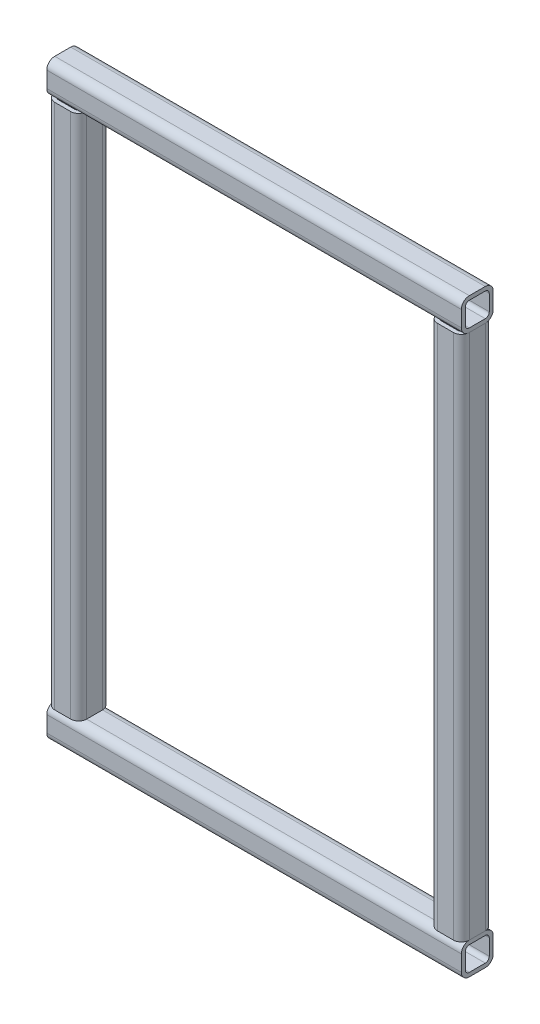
ISO-10303-21;
HEADER;
FILE_DESCRIPTION(('STEP AP214'),'2;1');
FILE_NAME('part.step','',(''),(''),'','','');
FILE_SCHEMA(('AUTOMOTIVE_DESIGN { 1 0 10303 214 1 1 1 1 }'));
ENDSEC;
DATA;
#1=APPLICATION_CONTEXT('core data for automotive mechanical design processes');
#2=APPLICATION_PROTOCOL_DEFINITION('international standard','automotive_design',2000,#1);
#3=PRODUCT_CONTEXT('',#1,'mechanical');
#4=PRODUCT('Part','Part','',(#3));
#5=PRODUCT_RELATED_PRODUCT_CATEGORY('part','',(#4));
#6=PRODUCT_DEFINITION_FORMATION('','',#4);
#7=PRODUCT_DEFINITION_CONTEXT('part definition',#1,'design');
#8=PRODUCT_DEFINITION('design','',#6,#7);
#9=PRODUCT_DEFINITION_SHAPE('','',#8);
#10=(LENGTH_UNIT() NAMED_UNIT(*) SI_UNIT(.MILLI.,.METRE.));
#11=(NAMED_UNIT(*) PLANE_ANGLE_UNIT() SI_UNIT($,.RADIAN.));
#12=(NAMED_UNIT(*) SI_UNIT($,.STERADIAN.) SOLID_ANGLE_UNIT());
#13=UNCERTAINTY_MEASURE_WITH_UNIT(LENGTH_MEASURE(1.E-05),#10,'distance_accuracy_value','');
#14=(GEOMETRIC_REPRESENTATION_CONTEXT(3) GLOBAL_UNCERTAINTY_ASSIGNED_CONTEXT((#13)) GLOBAL_UNIT_ASSIGNED_CONTEXT((#10,
#11,#12)) REPRESENTATION_CONTEXT('',''));
#15=CARTESIAN_POINT('',(0.,0.,0.));
#16=DIRECTION('',(0.,0.,1.));
#17=DIRECTION('',(1.,0.,0.));
#18=AXIS2_PLACEMENT_3D('',#15,#16,#17);
#19=CARTESIAN_POINT('',(0.,-12.7,12.7));
#20=DIRECTION('',(1.,0.,0.));
#21=DIRECTION('',(0.,0.,-1.));
#22=AXIS2_PLACEMENT_3D('',#19,#20,#21);
#23=CYLINDRICAL_SURFACE('',#22,12.7);
#24=CARTESIAN_POINT('',(-25.4,-12.7,12.7));
#25=DIRECTION('',(-1.,0.,0.));
#26=DIRECTION('',(0.,0.,1.));
#27=AXIS2_PLACEMENT_3D('',#24,#25,#26);
#28=CIRCLE('',#27,12.7);
#29=CARTESIAN_POINT('',(-25.4,-25.4,12.7));
#30=VERTEX_POINT('',#29);
#31=CARTESIAN_POINT('',(-25.4,-12.7,25.4));
#32=VERTEX_POINT('',#31);
#33=EDGE_CURVE('E174',#30,#32,#28,.T.);
#34=ORIENTED_EDGE('',*,*,#33,.F.);
#35=DIRECTION('',(1.,0.,0.));
#36=VECTOR('',#35,1.);
#37=CARTESIAN_POINT('',(0.,-25.4,12.7));
#38=LINE('',#37,#36);
#39=CARTESIAN_POINT('',(635.,-25.4,12.7));
#40=VERTEX_POINT('',#39);
#41=EDGE_CURVE('E50',#30,#40,#38,.T.);
#42=ORIENTED_EDGE('',*,*,#41,.T.);
#43=CARTESIAN_POINT('',(635.,-12.7,12.7));
#44=DIRECTION('',(1.,0.,0.));
#45=DIRECTION('',(0.,1.,0.));
#46=AXIS2_PLACEMENT_3D('',#43,#44,#45);
#47=CIRCLE('',#46,12.7);
#48=CARTESIAN_POINT('',(635.,-12.7,25.4));
#49=VERTEX_POINT('',#48);
#50=EDGE_CURVE('E255',#49,#40,#47,.T.);
#51=ORIENTED_EDGE('',*,*,#50,.F.);
#52=DIRECTION('',(1.,0.,0.));
#53=VECTOR('',#52,1.);
#54=CARTESIAN_POINT('',(0.,-12.7,25.4));
#55=LINE('',#54,#53);
#56=EDGE_CURVE('E248',#32,#49,#55,.T.);
#57=ORIENTED_EDGE('',*,*,#56,.F.);
#58=EDGE_LOOP('',(#34,#42,#51,#57));
#59=FACE_BOUND('',#58,.T.);
#60=ADVANCED_FACE('F46',(#59),#23,.T.);
#61=CARTESIAN_POINT('',(0.,-12.7,25.4));
#62=DIRECTION('',(0.,0.,-1.));
#63=DIRECTION('',(-1.,0.,0.));
#64=AXIS2_PLACEMENT_3D('',#61,#62,#63);
#65=PLANE('',#64);
#66=DIRECTION('',(0.,1.,0.));
#67=VECTOR('',#66,1.);
#68=CARTESIAN_POINT('',(-25.4,-12.7,25.4));
#69=LINE('',#68,#67);
#70=CARTESIAN_POINT('',(-25.4,12.7,25.4));
#71=VERTEX_POINT('',#70);
#72=EDGE_CURVE('E192',#32,#71,#69,.T.);
#73=ORIENTED_EDGE('',*,*,#72,.F.);
#74=ORIENTED_EDGE('',*,*,#56,.T.);
#75=DIRECTION('',(0.,-1.,0.));
#76=VECTOR('',#75,1.);
#77=CARTESIAN_POINT('',(635.,-12.6999999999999,25.4));
#78=LINE('',#77,#76);
#79=CARTESIAN_POINT('',(635.,12.7,25.4));
#80=VERTEX_POINT('',#79);
#81=EDGE_CURVE('E164',#80,#49,#78,.T.);
#82=ORIENTED_EDGE('',*,*,#81,.F.);
#83=DIRECTION('',(1.,0.,0.));
#84=VECTOR('',#83,1.);
#85=CARTESIAN_POINT('',(0.,12.7,25.4));
#86=LINE('',#85,#84);
#87=EDGE_CURVE('E247',#71,#80,#86,.T.);
#88=ORIENTED_EDGE('',*,*,#87,.F.);
#89=EDGE_LOOP('',(#73,#74,#82,#88));
#90=FACE_BOUND('',#89,.T.);
#91=ADVANCED_FACE('F302',(#90),#65,.F.);
#92=CARTESIAN_POINT('',(0.,12.7,12.7));
#93=DIRECTION('',(1.,0.,0.));
#94=DIRECTION('',(0.,0.,-1.));
#95=AXIS2_PLACEMENT_3D('',#92,#93,#94);
#96=CYLINDRICAL_SURFACE('',#95,12.7);
#97=CARTESIAN_POINT('',(-25.4,12.7,12.7));
#98=DIRECTION('',(-1.,0.,0.));
#99=DIRECTION('',(0.,0.,1.));
#100=AXIS2_PLACEMENT_3D('',#97,#98,#99);
#101=CIRCLE('',#100,12.7);
#102=CARTESIAN_POINT('',(-25.4,25.4,12.7));
#103=VERTEX_POINT('',#102);
#104=EDGE_CURVE('E189',#71,#103,#101,.T.);
#105=ORIENTED_EDGE('',*,*,#104,.F.);
#106=ORIENTED_EDGE('',*,*,#87,.T.);
#107=CARTESIAN_POINT('',(635.,12.7,12.7));
#108=DIRECTION('',(1.,0.,0.));
#109=DIRECTION('',(0.,1.,0.));
#110=AXIS2_PLACEMENT_3D('',#107,#108,#109);
#111=CIRCLE('',#110,12.7);
#112=CARTESIAN_POINT('',(635.,25.4,12.7));
#113=VERTEX_POINT('',#112);
#114=EDGE_CURVE('E175',#113,#80,#111,.T.);
#115=ORIENTED_EDGE('',*,*,#114,.F.);
#116=DIRECTION('',(1.,0.,0.));
#117=VECTOR('',#116,1.);
#118=CARTESIAN_POINT('',(0.,25.4,12.7));
#119=LINE('',#118,#117);
#120=EDGE_CURVE('E245',#103,#113,#119,.T.);
#121=ORIENTED_EDGE('',*,*,#120,.F.);
#122=EDGE_LOOP('',(#105,#106,#115,#121));
#123=FACE_BOUND('',#122,.T.);
#124=ADVANCED_FACE('F300',(#123),#96,.T.);
#125=CARTESIAN_POINT('',(0.,25.4,-12.7));
#126=DIRECTION('',(0.,-1.,0.));
#127=DIRECTION('',(0.,0.,-1.));
#128=AXIS2_PLACEMENT_3D('',#125,#126,#127);
#129=PLANE('',#128);
#130=DIRECTION('',(0.,0.,-1.));
#131=VECTOR('',#130,1.);
#132=CARTESIAN_POINT('',(-25.4,25.4,-12.7));
#133=LINE('',#132,#131);
#134=CARTESIAN_POINT('',(-25.4,25.4,-12.7));
#135=VERTEX_POINT('',#134);
#136=EDGE_CURVE('E184',#103,#135,#133,.T.);
#137=ORIENTED_EDGE('',*,*,#136,.F.);
#138=ORIENTED_EDGE('',*,*,#120,.T.);
#139=DIRECTION('',(0.,0.,1.));
#140=VECTOR('',#139,1.);
#141=CARTESIAN_POINT('',(635.,25.4,-12.7));
#142=LINE('',#141,#140);
#143=CARTESIAN_POINT('',(635.,25.4,-12.7));
#144=VERTEX_POINT('',#143);
#145=EDGE_CURVE('E294',#144,#113,#142,.T.);
#146=ORIENTED_EDGE('',*,*,#145,.F.);
#147=DIRECTION('',(1.,0.,0.));
#148=VECTOR('',#147,1.);
#149=CARTESIAN_POINT('',(0.,25.4,-12.7));
#150=LINE('',#149,#148);
#151=EDGE_CURVE('E243',#135,#144,#150,.T.);
#152=ORIENTED_EDGE('',*,*,#151,.F.);
#153=EDGE_LOOP('',(#137,#138,#146,#152));
#154=FACE_BOUND('',#153,.T.);
#155=ADVANCED_FACE('F309',(#154),#129,.F.);
#156=CARTESIAN_POINT('',(0.,12.7,-12.7));
#157=DIRECTION('',(1.,0.,0.));
#158=DIRECTION('',(0.,0.,-1.));
#159=AXIS2_PLACEMENT_3D('',#156,#157,#158);
#160=CYLINDRICAL_SURFACE('',#159,12.7);
#161=CARTESIAN_POINT('',(-25.4,12.7,-12.7));
#162=DIRECTION('',(-1.,0.,0.));
#163=DIRECTION('',(0.,0.,1.));
#164=AXIS2_PLACEMENT_3D('',#161,#162,#163);
#165=CIRCLE('',#164,12.7);
#166=CARTESIAN_POINT('',(-25.4,12.7,-25.4));
#167=VERTEX_POINT('',#166);
#168=EDGE_CURVE('E180',#135,#167,#165,.T.);
#169=ORIENTED_EDGE('',*,*,#168,.F.);
#170=ORIENTED_EDGE('',*,*,#151,.T.);
#171=CARTESIAN_POINT('',(635.,12.7,-12.7));
#172=DIRECTION('',(1.,0.,0.));
#173=DIRECTION('',(0.,1.,0.));
#174=AXIS2_PLACEMENT_3D('',#171,#172,#173);
#175=CIRCLE('',#174,12.7);
#176=CARTESIAN_POINT('',(635.,12.7,-25.4));
#177=VERTEX_POINT('',#176);
#178=EDGE_CURVE('E291',#177,#144,#175,.T.);
#179=ORIENTED_EDGE('',*,*,#178,.F.);
#180=DIRECTION('',(1.,0.,0.));
#181=VECTOR('',#180,1.);
#182=CARTESIAN_POINT('',(0.,12.7,-25.4));
#183=LINE('',#182,#181);
#184=EDGE_CURVE('E241',#167,#177,#183,.T.);
#185=ORIENTED_EDGE('',*,*,#184,.F.);
#186=EDGE_LOOP('',(#169,#170,#179,#185));
#187=FACE_BOUND('',#186,.T.);
#188=ADVANCED_FACE('F314',(#187),#160,.T.);
#189=CARTESIAN_POINT('',(0.,12.7,-25.4));
#190=DIRECTION('',(0.,0.,1.));
#191=DIRECTION('',(1.,0.,0.));
#192=AXIS2_PLACEMENT_3D('',#189,#190,#191);
#193=PLANE('',#192);
#194=DIRECTION('',(0.,-1.,0.));
#195=VECTOR('',#194,1.);
#196=CARTESIAN_POINT('',(-25.4,12.7,-25.4));
#197=LINE('',#196,#195);
#198=CARTESIAN_POINT('',(-25.4,-12.7,-25.4));
#199=VERTEX_POINT('',#198);
#200=EDGE_CURVE('E56',#167,#199,#197,.T.);
#201=ORIENTED_EDGE('',*,*,#200,.F.);
#202=ORIENTED_EDGE('',*,*,#184,.T.);
#203=DIRECTION('',(0.,1.,0.));
#204=VECTOR('',#203,1.);
#205=CARTESIAN_POINT('',(635.,12.7000000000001,-25.4));
#206=LINE('',#205,#204);
#207=CARTESIAN_POINT('',(635.,-12.7,-25.4));
#208=VERTEX_POINT('',#207);
#209=EDGE_CURVE('E288',#208,#177,#206,.T.);
#210=ORIENTED_EDGE('',*,*,#209,.F.);
#211=DIRECTION('',(1.,0.,0.));
#212=VECTOR('',#211,1.);
#213=CARTESIAN_POINT('',(0.,-12.7,-25.4));
#214=LINE('',#213,#212);
#215=EDGE_CURVE('E199',#199,#208,#214,.T.);
#216=ORIENTED_EDGE('',*,*,#215,.F.);
#217=EDGE_LOOP('',(#201,#202,#210,#216));
#218=FACE_BOUND('',#217,.T.);
#219=ADVANCED_FACE('F318',(#218),#193,.F.);
#220=CARTESIAN_POINT('',(0.,-12.7,-12.7));
#221=DIRECTION('',(1.,0.,0.));
#222=DIRECTION('',(0.,0.,-1.));
#223=AXIS2_PLACEMENT_3D('',#220,#221,#222);
#224=CYLINDRICAL_SURFACE('',#223,12.7);
#225=CARTESIAN_POINT('',(-25.4,-12.7,-12.7));
#226=DIRECTION('',(-1.,0.,0.));
#227=DIRECTION('',(0.,0.,1.));
#228=AXIS2_PLACEMENT_3D('',#225,#226,#227);
#229=CIRCLE('',#228,12.7);
#230=CARTESIAN_POINT('',(-25.4,-25.4,-12.7));
#231=VERTEX_POINT('',#230);
#232=EDGE_CURVE('E12',#199,#231,#229,.T.);
#233=ORIENTED_EDGE('',*,*,#232,.F.);
#234=ORIENTED_EDGE('',*,*,#215,.T.);
#235=CARTESIAN_POINT('',(635.,-12.7,-12.7));
#236=DIRECTION('',(1.,0.,0.));
#237=DIRECTION('',(0.,1.,0.));
#238=AXIS2_PLACEMENT_3D('',#235,#236,#237);
#239=CIRCLE('',#238,12.7);
#240=CARTESIAN_POINT('',(635.,-25.4,-12.7));
#241=VERTEX_POINT('',#240);
#242=EDGE_CURVE('E160',#241,#208,#239,.T.);
#243=ORIENTED_EDGE('',*,*,#242,.F.);
#244=DIRECTION('',(1.,0.,0.));
#245=VECTOR('',#244,1.);
#246=CARTESIAN_POINT('',(0.,-25.4,-12.7));
#247=LINE('',#246,#245);
#248=EDGE_CURVE('E155',#231,#241,#247,.T.);
#249=ORIENTED_EDGE('',*,*,#248,.F.);
#250=EDGE_LOOP('',(#233,#234,#243,#249));
#251=FACE_BOUND('',#250,.T.);
#252=ADVANCED_FACE('F157',(#251),#224,.T.);
#253=CARTESIAN_POINT('',(0.,12.7,12.7));
#254=DIRECTION('',(1.,0.,0.));
#255=DIRECTION('',(0.,0.,-1.));
#256=AXIS2_PLACEMENT_3D('',#253,#254,#255);
#257=CYLINDRICAL_SURFACE('',#256,6.35);
#258=DIRECTION('',(1.,0.,0.));
#259=VECTOR('',#258,1.);
#260=CARTESIAN_POINT('',(0.,12.7,19.05));
#261=LINE('',#260,#259);
#262=CARTESIAN_POINT('',(-25.4,12.7,19.05));
#263=VERTEX_POINT('',#262);
#264=CARTESIAN_POINT('',(635.,12.7,19.05));
#265=VERTEX_POINT('',#264);
#266=EDGE_CURVE('E203',#263,#265,#261,.T.);
#267=ORIENTED_EDGE('',*,*,#266,.F.);
#268=CARTESIAN_POINT('',(-25.4,12.7,12.7));
#269=DIRECTION('',(-1.,0.,0.));
#270=DIRECTION('',(0.,0.,1.));
#271=AXIS2_PLACEMENT_3D('',#268,#269,#270);
#272=CIRCLE('',#271,6.35);
#273=CARTESIAN_POINT('',(-25.4,19.05,12.7));
#274=VERTEX_POINT('',#273);
#275=EDGE_CURVE('E196',#263,#274,#272,.T.);
#276=ORIENTED_EDGE('',*,*,#275,.T.);
#277=DIRECTION('',(1.,0.,0.));
#278=VECTOR('',#277,1.);
#279=CARTESIAN_POINT('',(0.,19.05,12.7));
#280=LINE('',#279,#278);
#281=CARTESIAN_POINT('',(635.,19.05,12.7));
#282=VERTEX_POINT('',#281);
#283=EDGE_CURVE('E198',#274,#282,#280,.T.);
#284=ORIENTED_EDGE('',*,*,#283,.T.);
#285=CARTESIAN_POINT('',(635.,12.7,12.7));
#286=DIRECTION('',(1.,0.,0.));
#287=DIRECTION('',(0.,1.,0.));
#288=AXIS2_PLACEMENT_3D('',#285,#286,#287);
#289=CIRCLE('',#288,6.35);
#290=EDGE_CURVE('E204',#282,#265,#289,.T.);
#291=ORIENTED_EDGE('',*,*,#290,.T.);
#292=EDGE_LOOP('',(#267,#276,#284,#291));
#293=FACE_BOUND('',#292,.T.);
#294=ADVANCED_FACE('F324',(#293),#257,.F.);
#295=CARTESIAN_POINT('',(0.,-12.7,19.05));
#296=DIRECTION('',(0.,0.,-1.));
#297=DIRECTION('',(-1.,0.,0.));
#298=AXIS2_PLACEMENT_3D('',#295,#296,#297);
#299=PLANE('',#298);
#300=DIRECTION('',(1.,0.,0.));
#301=VECTOR('',#300,1.);
#302=CARTESIAN_POINT('',(0.,-12.7,19.05));
#303=LINE('',#302,#301);
#304=CARTESIAN_POINT('',(-25.4,-12.7,19.05));
#305=VERTEX_POINT('',#304);
#306=CARTESIAN_POINT('',(635.,-12.7,19.05));
#307=VERTEX_POINT('',#306);
#308=EDGE_CURVE('E208',#305,#307,#303,.T.);
#309=ORIENTED_EDGE('',*,*,#308,.F.);
#310=DIRECTION('',(0.,1.,0.));
#311=VECTOR('',#310,1.);
#312=CARTESIAN_POINT('',(-25.4,-12.7,19.05));
#313=LINE('',#312,#311);
#314=EDGE_CURVE('E200',#305,#263,#313,.T.);
#315=ORIENTED_EDGE('',*,*,#314,.T.);
#316=ORIENTED_EDGE('',*,*,#266,.T.);
#317=DIRECTION('',(0.,-1.,0.));
#318=VECTOR('',#317,1.);
#319=CARTESIAN_POINT('',(635.,-12.6999999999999,19.05));
#320=LINE('',#319,#318);
#321=EDGE_CURVE('E209',#265,#307,#320,.T.);
#322=ORIENTED_EDGE('',*,*,#321,.T.);
#323=EDGE_LOOP('',(#309,#315,#316,#322));
#324=FACE_BOUND('',#323,.T.);
#325=ADVANCED_FACE('F330',(#324),#299,.T.);
#326=CARTESIAN_POINT('',(0.,-12.7,12.7));
#327=DIRECTION('',(1.,0.,0.));
#328=DIRECTION('',(0.,0.,-1.));
#329=AXIS2_PLACEMENT_3D('',#326,#327,#328);
#330=CYLINDRICAL_SURFACE('',#329,6.35);
#331=DIRECTION('',(1.,0.,0.));
#332=VECTOR('',#331,1.);
#333=CARTESIAN_POINT('',(0.,-19.05,12.7));
#334=LINE('',#333,#332);
#335=CARTESIAN_POINT('',(-25.4,-19.05,12.7));
#336=VERTEX_POINT('',#335);
#337=CARTESIAN_POINT('',(635.,-19.05,12.7));
#338=VERTEX_POINT('',#337);
#339=EDGE_CURVE('E213',#336,#338,#334,.T.);
#340=ORIENTED_EDGE('',*,*,#339,.F.);
#341=CARTESIAN_POINT('',(-25.4,-12.7,12.7));
#342=DIRECTION('',(-1.,0.,0.));
#343=DIRECTION('',(0.,0.,1.));
#344=AXIS2_PLACEMENT_3D('',#341,#342,#343);
#345=CIRCLE('',#344,6.35);
#346=EDGE_CURVE('E205',#336,#305,#345,.T.);
#347=ORIENTED_EDGE('',*,*,#346,.T.);
#348=ORIENTED_EDGE('',*,*,#308,.T.);
#349=CARTESIAN_POINT('',(635.,-12.7,12.7));
#350=DIRECTION('',(1.,0.,0.));
#351=DIRECTION('',(0.,1.,0.));
#352=AXIS2_PLACEMENT_3D('',#349,#350,#351);
#353=CIRCLE('',#352,6.35);
#354=EDGE_CURVE('E214',#307,#338,#353,.T.);
#355=ORIENTED_EDGE('',*,*,#354,.T.);
#356=EDGE_LOOP('',(#340,#347,#348,#355));
#357=FACE_BOUND('',#356,.T.);
#358=ADVANCED_FACE('F334',(#357),#330,.F.);
#359=CARTESIAN_POINT('',(0.,-19.05,12.7));
#360=DIRECTION('',(0.,1.,0.));
#361=DIRECTION('',(0.,0.,1.));
#362=AXIS2_PLACEMENT_3D('',#359,#360,#361);
#363=PLANE('',#362);
#364=DIRECTION('',(1.,0.,0.));
#365=VECTOR('',#364,1.);
#366=CARTESIAN_POINT('',(0.,-19.05,-12.7));
#367=LINE('',#366,#365);
#368=CARTESIAN_POINT('',(-25.4,-19.05,-12.7));
#369=VERTEX_POINT('',#368);
#370=CARTESIAN_POINT('',(635.,-19.05,-12.7));
#371=VERTEX_POINT('',#370);
#372=EDGE_CURVE('E218',#369,#371,#367,.T.);
#373=ORIENTED_EDGE('',*,*,#372,.F.);
#374=DIRECTION('',(0.,0.,1.));
#375=VECTOR('',#374,1.);
#376=CARTESIAN_POINT('',(-25.4,-19.05,12.7));
#377=LINE('',#376,#375);
#378=EDGE_CURVE('E210',#369,#336,#377,.T.);
#379=ORIENTED_EDGE('',*,*,#378,.T.);
#380=ORIENTED_EDGE('',*,*,#339,.T.);
#381=DIRECTION('',(0.,0.,-1.));
#382=VECTOR('',#381,1.);
#383=CARTESIAN_POINT('',(635.,-19.05,12.7));
#384=LINE('',#383,#382);
#385=EDGE_CURVE('E219',#338,#371,#384,.T.);
#386=ORIENTED_EDGE('',*,*,#385,.T.);
#387=EDGE_LOOP('',(#373,#379,#380,#386));
#388=FACE_BOUND('',#387,.T.);
#389=ADVANCED_FACE('F338',(#388),#363,.T.);
#390=CARTESIAN_POINT('',(0.,-12.7,-12.7));
#391=DIRECTION('',(1.,0.,0.));
#392=DIRECTION('',(0.,0.,-1.));
#393=AXIS2_PLACEMENT_3D('',#390,#391,#392);
#394=CYLINDRICAL_SURFACE('',#393,6.35);
#395=DIRECTION('',(1.,0.,0.));
#396=VECTOR('',#395,1.);
#397=CARTESIAN_POINT('',(0.,-12.7,-19.05));
#398=LINE('',#397,#396);
#399=CARTESIAN_POINT('',(-25.4,-12.7,-19.05));
#400=VERTEX_POINT('',#399);
#401=CARTESIAN_POINT('',(635.,-12.7,-19.05));
#402=VERTEX_POINT('',#401);
#403=EDGE_CURVE('E223',#400,#402,#398,.T.);
#404=ORIENTED_EDGE('',*,*,#403,.F.);
#405=CARTESIAN_POINT('',(-25.4,-12.7,-12.7));
#406=DIRECTION('',(-1.,0.,0.));
#407=DIRECTION('',(0.,0.,1.));
#408=AXIS2_PLACEMENT_3D('',#405,#406,#407);
#409=CIRCLE('',#408,6.35);
#410=EDGE_CURVE('E215',#400,#369,#409,.T.);
#411=ORIENTED_EDGE('',*,*,#410,.T.);
#412=ORIENTED_EDGE('',*,*,#372,.T.);
#413=CARTESIAN_POINT('',(635.,-12.7,-12.7));
#414=DIRECTION('',(1.,0.,0.));
#415=DIRECTION('',(0.,1.,0.));
#416=AXIS2_PLACEMENT_3D('',#413,#414,#415);
#417=CIRCLE('',#416,6.35);
#418=EDGE_CURVE('E224',#371,#402,#417,.T.);
#419=ORIENTED_EDGE('',*,*,#418,.T.);
#420=EDGE_LOOP('',(#404,#411,#412,#419));
#421=FACE_BOUND('',#420,.T.);
#422=ADVANCED_FACE('F342',(#421),#394,.F.);
#423=CARTESIAN_POINT('',(0.,12.7,-19.05));
#424=DIRECTION('',(0.,0.,1.));
#425=DIRECTION('',(1.,0.,0.));
#426=AXIS2_PLACEMENT_3D('',#423,#424,#425);
#427=PLANE('',#426);
#428=DIRECTION('',(1.,0.,0.));
#429=VECTOR('',#428,1.);
#430=CARTESIAN_POINT('',(0.,12.7,-19.05));
#431=LINE('',#430,#429);
#432=CARTESIAN_POINT('',(-25.4,12.7,-19.05));
#433=VERTEX_POINT('',#432);
#434=CARTESIAN_POINT('',(635.,12.7,-19.05));
#435=VERTEX_POINT('',#434);
#436=EDGE_CURVE('E227',#433,#435,#431,.T.);
#437=ORIENTED_EDGE('',*,*,#436,.F.);
#438=DIRECTION('',(0.,-1.,0.));
#439=VECTOR('',#438,1.);
#440=CARTESIAN_POINT('',(-25.4,12.7,-19.05));
#441=LINE('',#440,#439);
#442=EDGE_CURVE('E220',#433,#400,#441,.T.);
#443=ORIENTED_EDGE('',*,*,#442,.T.);
#444=ORIENTED_EDGE('',*,*,#403,.T.);
#445=DIRECTION('',(0.,1.,0.));
#446=VECTOR('',#445,1.);
#447=CARTESIAN_POINT('',(635.,12.7000000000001,-19.05));
#448=LINE('',#447,#446);
#449=EDGE_CURVE('E228',#402,#435,#448,.T.);
#450=ORIENTED_EDGE('',*,*,#449,.T.);
#451=EDGE_LOOP('',(#437,#443,#444,#450));
#452=FACE_BOUND('',#451,.T.);
#453=ADVANCED_FACE('F346',(#452),#427,.T.);
#454=CARTESIAN_POINT('',(0.,12.7,-12.7));
#455=DIRECTION('',(1.,0.,0.));
#456=DIRECTION('',(0.,0.,-1.));
#457=AXIS2_PLACEMENT_3D('',#454,#455,#456);
#458=CYLINDRICAL_SURFACE('',#457,6.35);
#459=DIRECTION('',(1.,0.,0.));
#460=VECTOR('',#459,1.);
#461=CARTESIAN_POINT('',(0.,19.05,-12.7));
#462=LINE('',#461,#460);
#463=CARTESIAN_POINT('',(-25.4,19.05,-12.7));
#464=VERTEX_POINT('',#463);
#465=CARTESIAN_POINT('',(635.,19.05,-12.7));
#466=VERTEX_POINT('',#465);
#467=EDGE_CURVE('E230',#464,#466,#462,.T.);
#468=ORIENTED_EDGE('',*,*,#467,.F.);
#469=CARTESIAN_POINT('',(-25.4,12.7,-12.7));
#470=DIRECTION('',(-1.,0.,0.));
#471=DIRECTION('',(0.,0.,1.));
#472=AXIS2_PLACEMENT_3D('',#469,#470,#471);
#473=CIRCLE('',#472,6.35);
#474=EDGE_CURVE('E225',#464,#433,#473,.T.);
#475=ORIENTED_EDGE('',*,*,#474,.T.);
#476=ORIENTED_EDGE('',*,*,#436,.T.);
#477=CARTESIAN_POINT('',(635.,12.7,-12.7));
#478=DIRECTION('',(1.,0.,0.));
#479=DIRECTION('',(0.,1.,0.));
#480=AXIS2_PLACEMENT_3D('',#477,#478,#479);
#481=CIRCLE('',#480,6.35);
#482=EDGE_CURVE('E233',#435,#466,#481,.T.);
#483=ORIENTED_EDGE('',*,*,#482,.T.);
#484=EDGE_LOOP('',(#468,#475,#476,#483));
#485=FACE_BOUND('',#484,.T.);
#486=ADVANCED_FACE('F350',(#485),#458,.F.);
#487=CARTESIAN_POINT('',(0.,19.05,-12.7));
#488=DIRECTION('',(0.,-1.,0.));
#489=DIRECTION('',(0.,0.,-1.));
#490=AXIS2_PLACEMENT_3D('',#487,#488,#489);
#491=PLANE('',#490);
#492=ORIENTED_EDGE('',*,*,#283,.F.);
#493=DIRECTION('',(0.,0.,-1.));
#494=VECTOR('',#493,1.);
#495=CARTESIAN_POINT('',(-25.4,19.05,-12.7));
#496=LINE('',#495,#494);
#497=EDGE_CURVE('E64',#274,#464,#496,.T.);
#498=ORIENTED_EDGE('',*,*,#497,.T.);
#499=ORIENTED_EDGE('',*,*,#467,.T.);
#500=DIRECTION('',(0.,0.,1.));
#501=VECTOR('',#500,1.);
#502=CARTESIAN_POINT('',(635.,19.05,-12.7));
#503=LINE('',#502,#501);
#504=EDGE_CURVE('E165',#466,#282,#503,.T.);
#505=ORIENTED_EDGE('',*,*,#504,.T.);
#506=EDGE_LOOP('',(#492,#498,#499,#505));
#507=FACE_BOUND('',#506,.T.);
#508=ADVANCED_FACE('F327',(#507),#491,.T.);
#509=CARTESIAN_POINT('',(0.,-25.4,12.7));
#510=DIRECTION('',(0.,1.,0.));
#511=DIRECTION('',(0.,0.,1.));
#512=AXIS2_PLACEMENT_3D('',#509,#510,#511);
#513=PLANE('',#512);
#514=DIRECTION('',(0.,0.,1.));
#515=VECTOR('',#514,1.);
#516=CARTESIAN_POINT('',(-25.4,-25.4,12.7));
#517=LINE('',#516,#515);
#518=EDGE_CURVE('E169',#231,#30,#517,.T.);
#519=ORIENTED_EDGE('',*,*,#518,.F.);
#520=ORIENTED_EDGE('',*,*,#248,.T.);
#521=DIRECTION('',(0.,0.,-1.));
#522=VECTOR('',#521,1.);
#523=CARTESIAN_POINT('',(635.,-25.4,12.7));
#524=LINE('',#523,#522);
#525=EDGE_CURVE('E257',#40,#241,#524,.T.);
#526=ORIENTED_EDGE('',*,*,#525,.F.);
#527=ORIENTED_EDGE('',*,*,#41,.F.);
#528=EDGE_LOOP('',(#519,#520,#526,#527));
#529=FACE_BOUND('',#528,.T.);
#530=ADVANCED_FACE('F170',(#529),#513,.F.);
#531=CARTESIAN_POINT('',(635.,1.11022302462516E-13,25.4));
#532=DIRECTION('',(1.,0.,0.));
#533=DIRECTION('',(0.,1.,0.));
#534=AXIS2_PLACEMENT_3D('',#531,#532,#533);
#535=PLANE('',#534);
#536=ORIENTED_EDGE('',*,*,#290,.F.);
#537=ORIENTED_EDGE('',*,*,#504,.F.);
#538=ORIENTED_EDGE('',*,*,#482,.F.);
#539=ORIENTED_EDGE('',*,*,#449,.F.);
#540=ORIENTED_EDGE('',*,*,#418,.F.);
#541=ORIENTED_EDGE('',*,*,#385,.F.);
#542=ORIENTED_EDGE('',*,*,#354,.F.);
#543=ORIENTED_EDGE('',*,*,#321,.F.);
#544=EDGE_LOOP('',(#536,#537,#538,#539,#540,#541,#542,#543));
#545=FACE_BOUND('',#544,.T.);
#546=ORIENTED_EDGE('',*,*,#81,.T.);
#547=ORIENTED_EDGE('',*,*,#50,.T.);
#548=ORIENTED_EDGE('',*,*,#525,.T.);
#549=ORIENTED_EDGE('',*,*,#242,.T.);
#550=ORIENTED_EDGE('',*,*,#209,.T.);
#551=ORIENTED_EDGE('',*,*,#178,.T.);
#552=ORIENTED_EDGE('',*,*,#145,.T.);
#553=ORIENTED_EDGE('',*,*,#114,.T.);
#554=EDGE_LOOP('',(#546,#547,#548,#549,#550,#551,#552,#553));
#555=FACE_BOUND('',#554,.T.);
#556=ADVANCED_FACE('F260',(#545,#555),#535,.T.);
#557=CARTESIAN_POINT('',(-25.4,0.,-25.4));
#558=DIRECTION('',(-1.,0.,0.));
#559=DIRECTION('',(0.,0.,1.));
#560=AXIS2_PLACEMENT_3D('',#557,#558,#559);
#561=PLANE('',#560);
#562=ORIENTED_EDGE('',*,*,#275,.F.);
#563=ORIENTED_EDGE('',*,*,#314,.F.);
#564=ORIENTED_EDGE('',*,*,#346,.F.);
#565=ORIENTED_EDGE('',*,*,#378,.F.);
#566=ORIENTED_EDGE('',*,*,#410,.F.);
#567=ORIENTED_EDGE('',*,*,#442,.F.);
#568=ORIENTED_EDGE('',*,*,#474,.F.);
#569=ORIENTED_EDGE('',*,*,#497,.F.);
#570=EDGE_LOOP('',(#562,#563,#564,#565,#566,#567,#568,#569));
#571=FACE_BOUND('',#570,.T.);
#572=ORIENTED_EDGE('',*,*,#518,.T.);
#573=ORIENTED_EDGE('',*,*,#33,.T.);
#574=ORIENTED_EDGE('',*,*,#72,.T.);
#575=ORIENTED_EDGE('',*,*,#104,.T.);
#576=ORIENTED_EDGE('',*,*,#136,.T.);
#577=ORIENTED_EDGE('',*,*,#168,.T.);
#578=ORIENTED_EDGE('',*,*,#200,.T.);
#579=ORIENTED_EDGE('',*,*,#232,.T.);
#580=EDGE_LOOP('',(#572,#573,#574,#575,#576,#577,#578,#579));
#581=FACE_BOUND('',#580,.T.);
#582=ADVANCED_FACE('F48',(#571,#581),#561,.T.);
#583=CLOSED_SHELL('',(#60,#91,#124,#155,#188,#219,#252,#294,#325,#358,#389,#422,#453,#486,#508,
#530,#556,#582));
#584=MANIFOLD_SOLID_BREP('B2',#583);
#585=CARTESIAN_POINT('',(-12.7,889.,12.7));
#586=DIRECTION('',(0.,-1.,0.));
#587=DIRECTION('',(0.,0.,-1.));
#588=AXIS2_PLACEMENT_3D('',#585,#586,#587);
#589=CYLINDRICAL_SURFACE('',#588,12.7);
#590=CARTESIAN_POINT('',(-12.7,25.4,12.7));
#591=DIRECTION('',(0.,-1.,0.));
#592=DIRECTION('',(0.,0.,-1.));
#593=AXIS2_PLACEMENT_3D('',#590,#591,#592);
#594=CIRCLE('',#593,12.7);
#595=CARTESIAN_POINT('',(-12.7000000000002,25.4,25.4));
#596=VERTEX_POINT('',#595);
#597=CARTESIAN_POINT('',(-25.4,25.4,12.7));
#598=VERTEX_POINT('',#597);
#599=EDGE_CURVE('E675',#596,#598,#594,.T.);
#600=ORIENTED_EDGE('',*,*,#599,.F.);
#601=DIRECTION('',(0.,-1.,0.));
#602=VECTOR('',#601,1.);
#603=CARTESIAN_POINT('',(-12.7,889.,25.4));
#604=LINE('',#603,#602);
#605=CARTESIAN_POINT('',(-12.7000000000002,863.6,25.4));
#606=VERTEX_POINT('',#605);
#607=EDGE_CURVE('E685',#606,#596,#604,.T.);
#608=ORIENTED_EDGE('',*,*,#607,.F.);
#609=CARTESIAN_POINT('',(-12.7,863.6,12.7));
#610=DIRECTION('',(0.,1.,0.));
#611=DIRECTION('',(0.,0.,1.));
#612=AXIS2_PLACEMENT_3D('',#609,#610,#611);
#613=CIRCLE('',#612,12.7);
#614=CARTESIAN_POINT('',(-25.4,863.6,12.7));
#615=VERTEX_POINT('',#614);
#616=EDGE_CURVE('E657',#615,#606,#613,.T.);
#617=ORIENTED_EDGE('',*,*,#616,.F.);
#618=DIRECTION('',(0.,-1.,0.));
#619=VECTOR('',#618,1.);
#620=CARTESIAN_POINT('',(-25.4,889.,12.7));
#621=LINE('',#620,#619);
#622=EDGE_CURVE('E681',#615,#598,#621,.T.);
#623=ORIENTED_EDGE('',*,*,#622,.T.);
#624=EDGE_LOOP('',(#600,#608,#617,#623));
#625=FACE_BOUND('',#624,.T.);
#626=ADVANCED_FACE('F494',(#625),#589,.T.);
#627=CARTESIAN_POINT('',(-12.7,889.,25.4));
#628=DIRECTION('',(0.,0.,-1.));
#629=DIRECTION('',(-1.,0.,0.));
#630=AXIS2_PLACEMENT_3D('',#627,#628,#629);
#631=PLANE('',#630);
#632=DIRECTION('',(-1.,0.,0.));
#633=VECTOR('',#632,1.);
#634=CARTESIAN_POINT('',(3830.92908102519,25.4,25.4));
#635=LINE('',#634,#633);
#636=CARTESIAN_POINT('',(12.7,25.4,25.4));
#637=VERTEX_POINT('',#636);
#638=EDGE_CURVE('E660',#637,#596,#635,.T.);
#639=ORIENTED_EDGE('',*,*,#638,.F.);
#640=DIRECTION('',(0.,-1.,0.));
#641=VECTOR('',#640,1.);
#642=CARTESIAN_POINT('',(12.7,889.,25.4));
#643=LINE('',#642,#641);
#644=CARTESIAN_POINT('',(12.7,863.6,25.4));
#645=VERTEX_POINT('',#644);
#646=EDGE_CURVE('E688',#645,#637,#643,.T.);
#647=ORIENTED_EDGE('',*,*,#646,.F.);
#648=DIRECTION('',(-1.,0.,0.));
#649=VECTOR('',#648,1.);
#650=CARTESIAN_POINT('',(3679.39512030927,863.6,25.4));
#651=LINE('',#650,#649);
#652=EDGE_CURVE('E684',#645,#606,#651,.T.);
#653=ORIENTED_EDGE('',*,*,#652,.T.);
#654=ORIENTED_EDGE('',*,*,#607,.T.);
#655=EDGE_LOOP('',(#639,#647,#653,#654));
#656=FACE_BOUND('',#655,.T.);
#657=ADVANCED_FACE('F773',(#656),#631,.F.);
#658=CARTESIAN_POINT('',(12.7,889.,12.7));
#659=DIRECTION('',(0.,-1.,0.));
#660=DIRECTION('',(0.,0.,-1.));
#661=AXIS2_PLACEMENT_3D('',#658,#659,#660);
#662=CYLINDRICAL_SURFACE('',#661,12.7);
#663=CARTESIAN_POINT('',(12.7,25.4,12.7));
#664=DIRECTION('',(0.,-1.,0.));
#665=DIRECTION('',(0.,0.,-1.));
#666=AXIS2_PLACEMENT_3D('',#663,#664,#665);
#667=CIRCLE('',#666,12.7);
#668=CARTESIAN_POINT('',(25.4,25.4,12.7));
#669=VERTEX_POINT('',#668);
#670=EDGE_CURVE('E659',#669,#637,#667,.T.);
#671=ORIENTED_EDGE('',*,*,#670,.F.);
#672=DIRECTION('',(0.,-1.,0.));
#673=VECTOR('',#672,1.);
#674=CARTESIAN_POINT('',(25.4,889.,12.7));
#675=LINE('',#674,#673);
#676=CARTESIAN_POINT('',(25.4,863.6,12.7));
#677=VERTEX_POINT('',#676);
#678=EDGE_CURVE('E690',#677,#669,#675,.T.);
#679=ORIENTED_EDGE('',*,*,#678,.F.);
#680=CARTESIAN_POINT('',(12.7,863.6,12.7));
#681=DIRECTION('',(0.,1.,0.));
#682=DIRECTION('',(0.,0.,1.));
#683=AXIS2_PLACEMENT_3D('',#680,#681,#682);
#684=CIRCLE('',#683,12.7);
#685=EDGE_CURVE('E586',#645,#677,#684,.T.);
#686=ORIENTED_EDGE('',*,*,#685,.F.);
#687=ORIENTED_EDGE('',*,*,#646,.T.);
#688=EDGE_LOOP('',(#671,#679,#686,#687));
#689=FACE_BOUND('',#688,.T.);
#690=ADVANCED_FACE('F699',(#689),#662,.T.);
#691=CARTESIAN_POINT('',(25.4,889.,-12.7));
#692=DIRECTION('',(-1.,0.,0.));
#693=DIRECTION('',(0.,0.,1.));
#694=AXIS2_PLACEMENT_3D('',#691,#692,#693);
#695=PLANE('',#694);
#696=DIRECTION('',(0.,0.,1.));
#697=VECTOR('',#696,1.);
#698=CARTESIAN_POINT('',(25.4,25.4,-12.7));
#699=LINE('',#698,#697);
#700=CARTESIAN_POINT('',(25.4,25.4,-12.7));
#701=VERTEX_POINT('',#700);
#702=EDGE_CURVE('E44',#701,#669,#699,.T.);
#703=ORIENTED_EDGE('',*,*,#702,.F.);
#704=DIRECTION('',(0.,-1.,0.));
#705=VECTOR('',#704,1.);
#706=CARTESIAN_POINT('',(25.4,889.,-12.7));
#707=LINE('',#706,#705);
#708=CARTESIAN_POINT('',(25.4,863.6,-12.7));
#709=VERTEX_POINT('',#708);
#710=EDGE_CURVE('E562',#709,#701,#707,.T.);
#711=ORIENTED_EDGE('',*,*,#710,.F.);
#712=DIRECTION('',(0.,0.,-1.));
#713=VECTOR('',#712,1.);
#714=CARTESIAN_POINT('',(25.4,863.6,-12.7));
#715=LINE('',#714,#713);
#716=EDGE_CURVE('E649',#677,#709,#715,.T.);
#717=ORIENTED_EDGE('',*,*,#716,.F.);
#718=ORIENTED_EDGE('',*,*,#678,.T.);
#719=EDGE_LOOP('',(#703,#711,#717,#718));
#720=FACE_BOUND('',#719,.T.);
#721=ADVANCED_FACE('F695',(#720),#695,.F.);
#722=CARTESIAN_POINT('',(12.7,889.,-12.7));
#723=DIRECTION('',(0.,-1.,0.));
#724=DIRECTION('',(0.,0.,-1.));
#725=AXIS2_PLACEMENT_3D('',#722,#723,#724);
#726=CYLINDRICAL_SURFACE('',#725,12.7);
#727=CARTESIAN_POINT('',(12.7,25.4,-12.7));
#728=DIRECTION('',(0.,-1.,0.));
#729=DIRECTION('',(0.,0.,-1.));
#730=AXIS2_PLACEMENT_3D('',#727,#728,#729);
#731=CIRCLE('',#730,12.7);
#732=CARTESIAN_POINT('',(12.7000000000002,25.4,-25.4));
#733=VERTEX_POINT('',#732);
#734=EDGE_CURVE('E503',#733,#701,#731,.T.);
#735=ORIENTED_EDGE('',*,*,#734,.F.);
#736=DIRECTION('',(0.,-1.,0.));
#737=VECTOR('',#736,1.);
#738=CARTESIAN_POINT('',(12.7,889.,-25.4));
#739=LINE('',#738,#737);
#740=CARTESIAN_POINT('',(12.7000000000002,863.6,-25.4));
#741=VERTEX_POINT('',#740);
#742=EDGE_CURVE('E561',#741,#733,#739,.T.);
#743=ORIENTED_EDGE('',*,*,#742,.F.);
#744=CARTESIAN_POINT('',(12.7,863.6,-12.7));
#745=DIRECTION('',(0.,1.,0.));
#746=DIRECTION('',(0.,0.,1.));
#747=AXIS2_PLACEMENT_3D('',#744,#745,#746);
#748=CIRCLE('',#747,12.7);
#749=EDGE_CURVE('E646',#709,#741,#748,.T.);
#750=ORIENTED_EDGE('',*,*,#749,.F.);
#751=ORIENTED_EDGE('',*,*,#710,.T.);
#752=EDGE_LOOP('',(#735,#743,#750,#751));
#753=FACE_BOUND('',#752,.T.);
#754=ADVANCED_FACE('F567',(#753),#726,.T.);
#755=CARTESIAN_POINT('',(12.7,889.,-25.4));
#756=DIRECTION('',(0.,0.,1.));
#757=DIRECTION('',(1.,0.,0.));
#758=AXIS2_PLACEMENT_3D('',#755,#756,#757);
#759=PLANE('',#758);
#760=DIRECTION('',(-1.,0.,0.));
#761=VECTOR('',#760,1.);
#762=CARTESIAN_POINT('',(3830.92908102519,25.4,-25.4));
#763=LINE('',#762,#761);
#764=CARTESIAN_POINT('',(-12.7,25.4,-25.4));
#765=VERTEX_POINT('',#764);
#766=EDGE_CURVE('E554',#733,#765,#763,.T.);
#767=ORIENTED_EDGE('',*,*,#766,.T.);
#768=DIRECTION('',(0.,-1.,0.));
#769=VECTOR('',#768,1.);
#770=CARTESIAN_POINT('',(-12.7,889.,-25.4));
#771=LINE('',#770,#769);
#772=CARTESIAN_POINT('',(-12.7,863.6,-25.4));
#773=VERTEX_POINT('',#772);
#774=EDGE_CURVE('E576',#773,#765,#771,.T.);
#775=ORIENTED_EDGE('',*,*,#774,.F.);
#776=DIRECTION('',(-1.,0.,0.));
#777=VECTOR('',#776,1.);
#778=CARTESIAN_POINT('',(3679.39512030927,863.6,-25.4));
#779=LINE('',#778,#777);
#780=EDGE_CURVE('E575',#741,#773,#779,.T.);
#781=ORIENTED_EDGE('',*,*,#780,.F.);
#782=ORIENTED_EDGE('',*,*,#742,.T.);
#783=EDGE_LOOP('',(#767,#775,#781,#782));
#784=FACE_BOUND('',#783,.T.);
#785=ADVANCED_FACE('F573',(#784),#759,.F.);
#786=CARTESIAN_POINT('',(-12.7,889.,-12.7));
#787=DIRECTION('',(0.,-1.,0.));
#788=DIRECTION('',(0.,0.,-1.));
#789=AXIS2_PLACEMENT_3D('',#786,#787,#788);
#790=CYLINDRICAL_SURFACE('',#789,12.7);
#791=CARTESIAN_POINT('',(-12.7,25.4,-12.7));
#792=DIRECTION('',(0.,-1.,0.));
#793=DIRECTION('',(0.,0.,-1.));
#794=AXIS2_PLACEMENT_3D('',#791,#792,#793);
#795=CIRCLE('',#794,12.7);
#796=CARTESIAN_POINT('',(-25.4,25.4,-12.7));
#797=VERTEX_POINT('',#796);
#798=EDGE_CURVE('E552',#797,#765,#795,.T.);
#799=ORIENTED_EDGE('',*,*,#798,.F.);
#800=DIRECTION('',(0.,-1.,0.));
#801=VECTOR('',#800,1.);
#802=CARTESIAN_POINT('',(-25.4,889.,-12.7));
#803=LINE('',#802,#801);
#804=CARTESIAN_POINT('',(-25.4,863.6,-12.7));
#805=VERTEX_POINT('',#804);
#806=EDGE_CURVE('E583',#805,#797,#803,.T.);
#807=ORIENTED_EDGE('',*,*,#806,.F.);
#808=CARTESIAN_POINT('',(-12.7,863.6,-12.7));
#809=DIRECTION('',(0.,1.,0.));
#810=DIRECTION('',(0.,0.,1.));
#811=AXIS2_PLACEMENT_3D('',#808,#809,#810);
#812=CIRCLE('',#811,12.7);
#813=EDGE_CURVE('E658',#773,#805,#812,.T.);
#814=ORIENTED_EDGE('',*,*,#813,.F.);
#815=ORIENTED_EDGE('',*,*,#774,.T.);
#816=EDGE_LOOP('',(#799,#807,#814,#815));
#817=FACE_BOUND('',#816,.T.);
#818=ADVANCED_FACE('F797',(#817),#790,.T.);
#819=CARTESIAN_POINT('',(12.7,889.,12.7));
#820=DIRECTION('',(0.,-1.,0.));
#821=DIRECTION('',(0.,0.,-1.));
#822=AXIS2_PLACEMENT_3D('',#819,#820,#821);
#823=CYLINDRICAL_SURFACE('',#822,6.35);
#824=DIRECTION('',(0.,-1.,0.));
#825=VECTOR('',#824,1.);
#826=CARTESIAN_POINT('',(19.05,889.,12.7));
#827=LINE('',#826,#825);
#828=CARTESIAN_POINT('',(19.05,863.6,12.7));
#829=VERTEX_POINT('',#828);
#830=CARTESIAN_POINT('',(19.05,25.4,12.7));
#831=VERTEX_POINT('',#830);
#832=EDGE_CURVE('E578',#829,#831,#827,.T.);
#833=ORIENTED_EDGE('',*,*,#832,.T.);
#834=CARTESIAN_POINT('',(12.7,25.4,12.7));
#835=DIRECTION('',(0.,-1.,0.));
#836=DIRECTION('',(0.,0.,-1.));
#837=AXIS2_PLACEMENT_3D('',#834,#835,#836);
#838=CIRCLE('',#837,6.35);
#839=CARTESIAN_POINT('',(12.7,25.4,19.05));
#840=VERTEX_POINT('',#839);
#841=EDGE_CURVE('E590',#831,#840,#838,.T.);
#842=ORIENTED_EDGE('',*,*,#841,.T.);
#843=DIRECTION('',(0.,-1.,0.));
#844=VECTOR('',#843,1.);
#845=CARTESIAN_POINT('',(12.7,889.,19.05));
#846=LINE('',#845,#844);
#847=CARTESIAN_POINT('',(12.7,863.6,19.05));
#848=VERTEX_POINT('',#847);
#849=EDGE_CURVE('E591',#848,#840,#846,.T.);
#850=ORIENTED_EDGE('',*,*,#849,.F.);
#851=CARTESIAN_POINT('',(12.7,863.6,12.7));
#852=DIRECTION('',(0.,1.,0.));
#853=DIRECTION('',(0.,0.,1.));
#854=AXIS2_PLACEMENT_3D('',#851,#852,#853);
#855=CIRCLE('',#854,6.35);
#856=EDGE_CURVE('E595',#848,#829,#855,.T.);
#857=ORIENTED_EDGE('',*,*,#856,.T.);
#858=EDGE_LOOP('',(#833,#842,#850,#857));
#859=FACE_BOUND('',#858,.T.);
#860=ADVANCED_FACE('F748',(#859),#823,.F.);
#861=CARTESIAN_POINT('',(-12.7,889.,19.05));
#862=DIRECTION('',(0.,0.,-1.));
#863=DIRECTION('',(-1.,0.,0.));
#864=AXIS2_PLACEMENT_3D('',#861,#862,#863);
#865=PLANE('',#864);
#866=ORIENTED_EDGE('',*,*,#849,.T.);
#867=DIRECTION('',(-1.,0.,0.));
#868=VECTOR('',#867,1.);
#869=CARTESIAN_POINT('',(-12.7,25.4,19.05));
#870=LINE('',#869,#868);
#871=CARTESIAN_POINT('',(-12.7,25.4,19.05));
#872=VERTEX_POINT('',#871);
#873=EDGE_CURVE('E594',#840,#872,#870,.T.);
#874=ORIENTED_EDGE('',*,*,#873,.T.);
#875=DIRECTION('',(0.,-1.,0.));
#876=VECTOR('',#875,1.);
#877=CARTESIAN_POINT('',(-12.7,889.,19.05));
#878=LINE('',#877,#876);
#879=CARTESIAN_POINT('',(-12.7,863.6,19.05));
#880=VERTEX_POINT('',#879);
#881=EDGE_CURVE('E596',#880,#872,#878,.T.);
#882=ORIENTED_EDGE('',*,*,#881,.F.);
#883=DIRECTION('',(1.,0.,0.));
#884=VECTOR('',#883,1.);
#885=CARTESIAN_POINT('',(-12.7,863.6,19.05));
#886=LINE('',#885,#884);
#887=EDGE_CURVE('E600',#880,#848,#886,.T.);
#888=ORIENTED_EDGE('',*,*,#887,.T.);
#889=EDGE_LOOP('',(#866,#874,#882,#888));
#890=FACE_BOUND('',#889,.T.);
#891=ADVANCED_FACE('F744',(#890),#865,.T.);
#892=CARTESIAN_POINT('',(-12.7,889.,12.7));
#893=DIRECTION('',(0.,-1.,0.));
#894=DIRECTION('',(0.,0.,-1.));
#895=AXIS2_PLACEMENT_3D('',#892,#893,#894);
#896=CYLINDRICAL_SURFACE('',#895,6.35);
#897=ORIENTED_EDGE('',*,*,#881,.T.);
#898=CARTESIAN_POINT('',(-12.7,25.4,12.7));
#899=DIRECTION('',(0.,-1.,0.));
#900=DIRECTION('',(0.,0.,-1.));
#901=AXIS2_PLACEMENT_3D('',#898,#899,#900);
#902=CIRCLE('',#901,6.35);
#903=CARTESIAN_POINT('',(-19.05,25.4,12.7));
#904=VERTEX_POINT('',#903);
#905=EDGE_CURVE('E599',#872,#904,#902,.T.);
#906=ORIENTED_EDGE('',*,*,#905,.T.);
#907=DIRECTION('',(0.,-1.,0.));
#908=VECTOR('',#907,1.);
#909=CARTESIAN_POINT('',(-19.05,889.,12.7));
#910=LINE('',#909,#908);
#911=CARTESIAN_POINT('',(-19.05,863.6,12.7));
#912=VERTEX_POINT('',#911);
#913=EDGE_CURVE('E601',#912,#904,#910,.T.);
#914=ORIENTED_EDGE('',*,*,#913,.F.);
#915=CARTESIAN_POINT('',(-12.7,863.6,12.7));
#916=DIRECTION('',(0.,1.,0.));
#917=DIRECTION('',(0.,0.,1.));
#918=AXIS2_PLACEMENT_3D('',#915,#916,#917);
#919=CIRCLE('',#918,6.35);
#920=EDGE_CURVE('E605',#912,#880,#919,.T.);
#921=ORIENTED_EDGE('',*,*,#920,.T.);
#922=EDGE_LOOP('',(#897,#906,#914,#921));
#923=FACE_BOUND('',#922,.T.);
#924=ADVANCED_FACE('F743',(#923),#896,.F.);
#925=CARTESIAN_POINT('',(-19.05,889.,12.7));
#926=DIRECTION('',(1.,0.,0.));
#927=DIRECTION('',(0.,0.,-1.));
#928=AXIS2_PLACEMENT_3D('',#925,#926,#927);
#929=PLANE('',#928);
#930=ORIENTED_EDGE('',*,*,#913,.T.);
#931=DIRECTION('',(0.,0.,-1.));
#932=VECTOR('',#931,1.);
#933=CARTESIAN_POINT('',(-19.05,25.4,12.7));
#934=LINE('',#933,#932);
#935=CARTESIAN_POINT('',(-19.05,25.4,-12.7));
#936=VERTEX_POINT('',#935);
#937=EDGE_CURVE('E604',#904,#936,#934,.T.);
#938=ORIENTED_EDGE('',*,*,#937,.T.);
#939=DIRECTION('',(0.,-1.,0.));
#940=VECTOR('',#939,1.);
#941=CARTESIAN_POINT('',(-19.05,889.,-12.7));
#942=LINE('',#941,#940);
#943=CARTESIAN_POINT('',(-19.05,863.6,-12.7));
#944=VERTEX_POINT('',#943);
#945=EDGE_CURVE('E606',#944,#936,#942,.T.);
#946=ORIENTED_EDGE('',*,*,#945,.F.);
#947=DIRECTION('',(0.,0.,1.));
#948=VECTOR('',#947,1.);
#949=CARTESIAN_POINT('',(-19.05,863.6,12.7));
#950=LINE('',#949,#948);
#951=EDGE_CURVE('E610',#944,#912,#950,.T.);
#952=ORIENTED_EDGE('',*,*,#951,.T.);
#953=EDGE_LOOP('',(#930,#938,#946,#952));
#954=FACE_BOUND('',#953,.T.);
#955=ADVANCED_FACE('F762',(#954),#929,.T.);
#956=CARTESIAN_POINT('',(-12.7,889.,-12.7));
#957=DIRECTION('',(0.,-1.,0.));
#958=DIRECTION('',(0.,0.,-1.));
#959=AXIS2_PLACEMENT_3D('',#956,#957,#958);
#960=CYLINDRICAL_SURFACE('',#959,6.35);
#961=ORIENTED_EDGE('',*,*,#945,.T.);
#962=CARTESIAN_POINT('',(-12.7,25.4,-12.7));
#963=DIRECTION('',(0.,-1.,0.));
#964=DIRECTION('',(0.,0.,-1.));
#965=AXIS2_PLACEMENT_3D('',#962,#963,#964);
#966=CIRCLE('',#965,6.35);
#967=CARTESIAN_POINT('',(-12.7,25.4,-19.05));
#968=VERTEX_POINT('',#967);
#969=EDGE_CURVE('E609',#936,#968,#966,.T.);
#970=ORIENTED_EDGE('',*,*,#969,.T.);
#971=DIRECTION('',(0.,-1.,0.));
#972=VECTOR('',#971,1.);
#973=CARTESIAN_POINT('',(-12.7,889.,-19.05));
#974=LINE('',#973,#972);
#975=CARTESIAN_POINT('',(-12.7,863.6,-19.05));
#976=VERTEX_POINT('',#975);
#977=EDGE_CURVE('E611',#976,#968,#974,.T.);
#978=ORIENTED_EDGE('',*,*,#977,.F.);
#979=CARTESIAN_POINT('',(-12.7,863.6,-12.7));
#980=DIRECTION('',(0.,1.,0.));
#981=DIRECTION('',(0.,0.,1.));
#982=AXIS2_PLACEMENT_3D('',#979,#980,#981);
#983=CIRCLE('',#982,6.35);
#984=EDGE_CURVE('E614',#976,#944,#983,.T.);
#985=ORIENTED_EDGE('',*,*,#984,.T.);
#986=EDGE_LOOP('',(#961,#970,#978,#985));
#987=FACE_BOUND('',#986,.T.);
#988=ADVANCED_FACE('F760',(#987),#960,.F.);
#989=CARTESIAN_POINT('',(12.7,889.,-19.05));
#990=DIRECTION('',(0.,0.,1.));
#991=DIRECTION('',(1.,0.,0.));
#992=AXIS2_PLACEMENT_3D('',#989,#990,#991);
#993=PLANE('',#992);
#994=ORIENTED_EDGE('',*,*,#977,.T.);
#995=DIRECTION('',(1.,0.,0.));
#996=VECTOR('',#995,1.);
#997=CARTESIAN_POINT('',(12.7,25.4,-19.05));
#998=LINE('',#997,#996);
#999=CARTESIAN_POINT('',(12.7,25.4,-19.05));
#1000=VERTEX_POINT('',#999);
#1001=EDGE_CURVE('E613',#968,#1000,#998,.T.);
#1002=ORIENTED_EDGE('',*,*,#1001,.T.);
#1003=DIRECTION('',(0.,-1.,0.));
#1004=VECTOR('',#1003,1.);
#1005=CARTESIAN_POINT('',(12.7,889.,-19.05));
#1006=LINE('',#1005,#1004);
#1007=CARTESIAN_POINT('',(12.7,863.6,-19.05));
#1008=VERTEX_POINT('',#1007);
#1009=EDGE_CURVE('E615',#1008,#1000,#1006,.T.);
#1010=ORIENTED_EDGE('',*,*,#1009,.F.);
#1011=DIRECTION('',(-1.,0.,0.));
#1012=VECTOR('',#1011,1.);
#1013=CARTESIAN_POINT('',(12.7,863.6,-19.05));
#1014=LINE('',#1013,#1012);
#1015=EDGE_CURVE('E618',#1008,#976,#1014,.T.);
#1016=ORIENTED_EDGE('',*,*,#1015,.T.);
#1017=EDGE_LOOP('',(#994,#1002,#1010,#1016));
#1018=FACE_BOUND('',#1017,.T.);
#1019=ADVANCED_FACE('F763',(#1018),#993,.T.);
#1020=CARTESIAN_POINT('',(12.7,889.,-12.7));
#1021=DIRECTION('',(0.,-1.,0.));
#1022=DIRECTION('',(0.,0.,-1.));
#1023=AXIS2_PLACEMENT_3D('',#1020,#1021,#1022);
#1024=CYLINDRICAL_SURFACE('',#1023,6.35);
#1025=ORIENTED_EDGE('',*,*,#1009,.T.);
#1026=CARTESIAN_POINT('',(12.7,25.4,-12.7));
#1027=DIRECTION('',(0.,-1.,0.));
#1028=DIRECTION('',(0.,0.,-1.));
#1029=AXIS2_PLACEMENT_3D('',#1026,#1027,#1028);
#1030=CIRCLE('',#1029,6.35);
#1031=CARTESIAN_POINT('',(19.05,25.4,-12.7));
#1032=VERTEX_POINT('',#1031);
#1033=EDGE_CURVE('E617',#1000,#1032,#1030,.T.);
#1034=ORIENTED_EDGE('',*,*,#1033,.T.);
#1035=DIRECTION('',(0.,-1.,0.));
#1036=VECTOR('',#1035,1.);
#1037=CARTESIAN_POINT('',(19.05,889.,-12.7));
#1038=LINE('',#1037,#1036);
#1039=CARTESIAN_POINT('',(19.05,863.6,-12.7));
#1040=VERTEX_POINT('',#1039);
#1041=EDGE_CURVE('E497',#1040,#1032,#1038,.T.);
#1042=ORIENTED_EDGE('',*,*,#1041,.F.);
#1043=CARTESIAN_POINT('',(12.7,863.6,-12.7));
#1044=DIRECTION('',(0.,1.,0.));
#1045=DIRECTION('',(0.,0.,1.));
#1046=AXIS2_PLACEMENT_3D('',#1043,#1044,#1045);
#1047=CIRCLE('',#1046,6.35);
#1048=EDGE_CURVE('E623',#1040,#1008,#1047,.T.);
#1049=ORIENTED_EDGE('',*,*,#1048,.T.);
#1050=EDGE_LOOP('',(#1025,#1034,#1042,#1049));
#1051=FACE_BOUND('',#1050,.T.);
#1052=ADVANCED_FACE('F756',(#1051),#1024,.F.);
#1053=CARTESIAN_POINT('',(19.05,889.,-12.7));
#1054=DIRECTION('',(-1.,0.,0.));
#1055=DIRECTION('',(0.,0.,1.));
#1056=AXIS2_PLACEMENT_3D('',#1053,#1054,#1055);
#1057=PLANE('',#1056);
#1058=ORIENTED_EDGE('',*,*,#1041,.T.);
#1059=DIRECTION('',(0.,0.,1.));
#1060=VECTOR('',#1059,1.);
#1061=CARTESIAN_POINT('',(19.05,25.4,-12.7));
#1062=LINE('',#1061,#1060);
#1063=EDGE_CURVE('E672',#1032,#831,#1062,.T.);
#1064=ORIENTED_EDGE('',*,*,#1063,.T.);
#1065=ORIENTED_EDGE('',*,*,#832,.F.);
#1066=DIRECTION('',(0.,0.,-1.));
#1067=VECTOR('',#1066,1.);
#1068=CARTESIAN_POINT('',(19.05,863.6,-12.7));
#1069=LINE('',#1068,#1067);
#1070=EDGE_CURVE('E587',#829,#1040,#1069,.T.);
#1071=ORIENTED_EDGE('',*,*,#1070,.T.);
#1072=EDGE_LOOP('',(#1058,#1064,#1065,#1071));
#1073=FACE_BOUND('',#1072,.T.);
#1074=ADVANCED_FACE('F754',(#1073),#1057,.T.);
#1075=CARTESIAN_POINT('',(-25.4,889.,12.7));
#1076=DIRECTION('',(1.,0.,0.));
#1077=DIRECTION('',(0.,0.,-1.));
#1078=AXIS2_PLACEMENT_3D('',#1075,#1076,#1077);
#1079=PLANE('',#1078);
#1080=DIRECTION('',(0.,0.,-1.));
#1081=VECTOR('',#1080,1.);
#1082=CARTESIAN_POINT('',(-25.4,25.4,12.7));
#1083=LINE('',#1082,#1081);
#1084=EDGE_CURVE('E678',#598,#797,#1083,.T.);
#1085=ORIENTED_EDGE('',*,*,#1084,.F.);
#1086=ORIENTED_EDGE('',*,*,#622,.F.);
#1087=DIRECTION('',(0.,0.,1.));
#1088=VECTOR('',#1087,1.);
#1089=CARTESIAN_POINT('',(-25.4,863.6,12.7));
#1090=LINE('',#1089,#1088);
#1091=EDGE_CURVE('E654',#805,#615,#1090,.T.);
#1092=ORIENTED_EDGE('',*,*,#1091,.F.);
#1093=ORIENTED_EDGE('',*,*,#806,.T.);
#1094=EDGE_LOOP('',(#1085,#1086,#1092,#1093));
#1095=FACE_BOUND('',#1094,.T.);
#1096=ADVANCED_FACE('F793',(#1095),#1079,.F.);
#1097=CARTESIAN_POINT('',(609.6,863.6,-12.7));
#1098=DIRECTION('',(0.,1.,0.));
#1099=DIRECTION('',(0.,0.,1.));
#1100=AXIS2_PLACEMENT_3D('',#1097,#1098,#1099);
#1101=PLANE('',#1100);
#1102=ORIENTED_EDGE('',*,*,#887,.F.);
#1103=ORIENTED_EDGE('',*,*,#920,.F.);
#1104=ORIENTED_EDGE('',*,*,#951,.F.);
#1105=ORIENTED_EDGE('',*,*,#984,.F.);
#1106=ORIENTED_EDGE('',*,*,#1015,.F.);
#1107=ORIENTED_EDGE('',*,*,#1048,.F.);
#1108=ORIENTED_EDGE('',*,*,#1070,.F.);
#1109=ORIENTED_EDGE('',*,*,#856,.F.);
#1110=EDGE_LOOP('',(#1102,#1103,#1104,#1105,#1106,#1107,#1108,#1109));
#1111=FACE_BOUND('',#1110,.T.);
#1112=ORIENTED_EDGE('',*,*,#685,.T.);
#1113=ORIENTED_EDGE('',*,*,#716,.T.);
#1114=ORIENTED_EDGE('',*,*,#749,.T.);
#1115=ORIENTED_EDGE('',*,*,#780,.T.);
#1116=ORIENTED_EDGE('',*,*,#813,.T.);
#1117=ORIENTED_EDGE('',*,*,#1091,.T.);
#1118=ORIENTED_EDGE('',*,*,#616,.T.);
#1119=ORIENTED_EDGE('',*,*,#652,.F.);
#1120=EDGE_LOOP('',(#1112,#1113,#1114,#1115,#1116,#1117,#1118,#1119));
#1121=FACE_BOUND('',#1120,.T.);
#1122=ADVANCED_FACE('F737',(#1111,#1121),#1101,.T.);
#1123=CARTESIAN_POINT('',(0.,25.4,-12.7));
#1124=DIRECTION('',(0.,-1.,0.));
#1125=DIRECTION('',(0.,0.,-1.));
#1126=AXIS2_PLACEMENT_3D('',#1123,#1124,#1125);
#1127=PLANE('',#1126);
#1128=ORIENTED_EDGE('',*,*,#1063,.F.);
#1129=ORIENTED_EDGE('',*,*,#1033,.F.);
#1130=ORIENTED_EDGE('',*,*,#1001,.F.);
#1131=ORIENTED_EDGE('',*,*,#969,.F.);
#1132=ORIENTED_EDGE('',*,*,#937,.F.);
#1133=ORIENTED_EDGE('',*,*,#905,.F.);
#1134=ORIENTED_EDGE('',*,*,#873,.F.);
#1135=ORIENTED_EDGE('',*,*,#841,.F.);
#1136=EDGE_LOOP('',(#1128,#1129,#1130,#1131,#1132,#1133,#1134,#1135));
#1137=FACE_BOUND('',#1136,.T.);
#1138=ORIENTED_EDGE('',*,*,#670,.T.);
#1139=ORIENTED_EDGE('',*,*,#638,.T.);
#1140=ORIENTED_EDGE('',*,*,#599,.T.);
#1141=ORIENTED_EDGE('',*,*,#1084,.T.);
#1142=ORIENTED_EDGE('',*,*,#798,.T.);
#1143=ORIENTED_EDGE('',*,*,#766,.F.);
#1144=ORIENTED_EDGE('',*,*,#734,.T.);
#1145=ORIENTED_EDGE('',*,*,#702,.T.);
#1146=EDGE_LOOP('',(#1138,#1139,#1140,#1141,#1142,#1143,#1144,#1145));
#1147=FACE_BOUND('',#1146,.T.);
#1148=ADVANCED_FACE('F556',(#1137,#1147),#1127,.T.);
#1149=CLOSED_SHELL('',(#626,#657,#690,#721,#754,#785,#818,#860,#891,#924,#955,#988,#1019,#1052,
#1074,#1096,#1122,#1148));
#1150=MANIFOLD_SOLID_BREP('B6',#1149);
#1151=CARTESIAN_POINT('',(622.3,1.11022302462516E-13,12.7));
#1152=DIRECTION('',(0.,1.,0.));
#1153=DIRECTION('',(0.,0.,1.));
#1154=AXIS2_PLACEMENT_3D('',#1151,#1152,#1153);
#1155=CYLINDRICAL_SURFACE('',#1154,12.7);
#1156=CARTESIAN_POINT('',(622.3,25.4,12.7));
#1157=DIRECTION('',(0.,-1.,0.));
#1158=DIRECTION('',(0.,0.,-1.));
#1159=AXIS2_PLACEMENT_3D('',#1156,#1157,#1158);
#1160=CIRCLE('',#1159,12.7);
#1161=CARTESIAN_POINT('',(635.,25.4,12.7));
#1162=VERTEX_POINT('',#1161);
#1163=CARTESIAN_POINT('',(622.3,25.4,25.4));
#1164=VERTEX_POINT('',#1163);
#1165=EDGE_CURVE('E492',#1162,#1164,#1160,.T.);
#1166=ORIENTED_EDGE('',*,*,#1165,.F.);
#1167=DIRECTION('',(0.,1.,0.));
#1168=VECTOR('',#1167,1.);
#1169=CARTESIAN_POINT('',(635.,1.11022302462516E-13,12.7));
#1170=LINE('',#1169,#1168);
#1171=CARTESIAN_POINT('',(635.,863.6,12.7));
#1172=VERTEX_POINT('',#1171);
#1173=EDGE_CURVE('E1159',#1162,#1172,#1170,.T.);
#1174=ORIENTED_EDGE('',*,*,#1173,.T.);
#1175=CARTESIAN_POINT('',(622.3,863.6,12.7));
#1176=DIRECTION('',(0.,1.,0.));
#1177=DIRECTION('',(0.,0.,1.));
#1178=AXIS2_PLACEMENT_3D('',#1175,#1176,#1177);
#1179=CIRCLE('',#1178,12.7);
#1180=CARTESIAN_POINT('',(622.3,863.6,25.4));
#1181=VERTEX_POINT('',#1180);
#1182=EDGE_CURVE('E1093',#1181,#1172,#1179,.T.);
#1183=ORIENTED_EDGE('',*,*,#1182,.F.);
#1184=DIRECTION('',(0.,1.,0.));
#1185=VECTOR('',#1184,1.);
#1186=CARTESIAN_POINT('',(622.3,1.11022302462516E-13,25.4));
#1187=LINE('',#1186,#1185);
#1188=EDGE_CURVE('E1158',#1164,#1181,#1187,.T.);
#1189=ORIENTED_EDGE('',*,*,#1188,.F.);
#1190=EDGE_LOOP('',(#1166,#1174,#1183,#1189));
#1191=FACE_BOUND('',#1190,.T.);
#1192=ADVANCED_FACE('F953',(#1191),#1155,.T.);
#1193=CARTESIAN_POINT('',(622.3,1.11022302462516E-13,25.4));
#1194=DIRECTION('',(0.,0.,-1.));
#1195=DIRECTION('',(-1.,0.,0.));
#1196=AXIS2_PLACEMENT_3D('',#1193,#1194,#1195);
#1197=PLANE('',#1196);
#1198=DIRECTION('',(1.,0.,0.));
#1199=VECTOR('',#1198,1.);
#1200=CARTESIAN_POINT('',(-3069.79512030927,25.4,25.4));
#1201=LINE('',#1200,#1199);
#1202=CARTESIAN_POINT('',(596.9,25.4,25.4));
#1203=VERTEX_POINT('',#1202);
#1204=EDGE_CURVE('E968',#1203,#1164,#1201,.T.);
#1205=ORIENTED_EDGE('',*,*,#1204,.T.);
#1206=ORIENTED_EDGE('',*,*,#1188,.T.);
#1207=DIRECTION('',(1.,0.,0.));
#1208=VECTOR('',#1207,1.);
#1209=CARTESIAN_POINT('',(-3221.32908102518,863.6,25.4));
#1210=LINE('',#1209,#1208);
#1211=CARTESIAN_POINT('',(596.9,863.6,25.4));
#1212=VERTEX_POINT('',#1211);
#1213=EDGE_CURVE('E1132',#1212,#1181,#1210,.T.);
#1214=ORIENTED_EDGE('',*,*,#1213,.F.);
#1215=DIRECTION('',(0.,1.,0.));
#1216=VECTOR('',#1215,1.);
#1217=CARTESIAN_POINT('',(596.9,1.11022302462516E-13,25.4));
#1218=LINE('',#1217,#1216);
#1219=EDGE_CURVE('E1162',#1203,#1212,#1218,.T.);
#1220=ORIENTED_EDGE('',*,*,#1219,.F.);
#1221=EDGE_LOOP('',(#1205,#1206,#1214,#1220));
#1222=FACE_BOUND('',#1221,.T.);
#1223=ADVANCED_FACE('F1216',(#1222),#1197,.F.);
#1224=CARTESIAN_POINT('',(596.9,1.11022302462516E-13,12.7));
#1225=DIRECTION('',(0.,1.,0.));
#1226=DIRECTION('',(0.,0.,1.));
#1227=AXIS2_PLACEMENT_3D('',#1224,#1225,#1226);
#1228=CYLINDRICAL_SURFACE('',#1227,12.7);
#1229=CARTESIAN_POINT('',(596.9,25.4,12.7));
#1230=DIRECTION('',(0.,-1.,0.));
#1231=DIRECTION('',(0.,0.,-1.));
#1232=AXIS2_PLACEMENT_3D('',#1229,#1230,#1231);
#1233=CIRCLE('',#1232,12.7);
#1234=CARTESIAN_POINT('',(584.2,25.4,12.7));
#1235=VERTEX_POINT('',#1234);
#1236=EDGE_CURVE('E1129',#1203,#1235,#1233,.T.);
#1237=ORIENTED_EDGE('',*,*,#1236,.F.);
#1238=ORIENTED_EDGE('',*,*,#1219,.T.);
#1239=CARTESIAN_POINT('',(596.9,863.6,12.7));
#1240=DIRECTION('',(0.,1.,0.));
#1241=DIRECTION('',(0.,0.,1.));
#1242=AXIS2_PLACEMENT_3D('',#1239,#1240,#1241);
#1243=CIRCLE('',#1242,12.7);
#1244=CARTESIAN_POINT('',(584.2,863.6,12.7));
#1245=VERTEX_POINT('',#1244);
#1246=EDGE_CURVE('E1089',#1245,#1212,#1243,.T.);
#1247=ORIENTED_EDGE('',*,*,#1246,.F.);
#1248=DIRECTION('',(0.,1.,0.));
#1249=VECTOR('',#1248,1.);
#1250=CARTESIAN_POINT('',(584.2,1.11022302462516E-13,12.7));
#1251=LINE('',#1250,#1249);
#1252=EDGE_CURVE('E1164',#1235,#1245,#1251,.T.);
#1253=ORIENTED_EDGE('',*,*,#1252,.F.);
#1254=EDGE_LOOP('',(#1237,#1238,#1247,#1253));
#1255=FACE_BOUND('',#1254,.T.);
#1256=ADVANCED_FACE('F1221',(#1255),#1228,.T.);
#1257=CARTESIAN_POINT('',(584.2,1.11022302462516E-13,-12.7));
#1258=DIRECTION('',(1.,0.,0.));
#1259=DIRECTION('',(0.,0.,-1.));
#1260=AXIS2_PLACEMENT_3D('',#1257,#1258,#1259);
#1261=PLANE('',#1260);
#1262=DIRECTION('',(0.,0.,-1.));
#1263=VECTOR('',#1262,1.);
#1264=CARTESIAN_POINT('',(584.2,25.4,-12.7));
#1265=LINE('',#1264,#1263);
#1266=CARTESIAN_POINT('',(584.2,25.4,-12.7));
#1267=VERTEX_POINT('',#1266);
#1268=EDGE_CURVE('E1137',#1235,#1267,#1265,.T.);
#1269=ORIENTED_EDGE('',*,*,#1268,.F.);
#1270=ORIENTED_EDGE('',*,*,#1252,.T.);
#1271=DIRECTION('',(0.,0.,1.));
#1272=VECTOR('',#1271,1.);
#1273=CARTESIAN_POINT('',(584.2,863.6,-12.7));
#1274=LINE('',#1273,#1272);
#1275=CARTESIAN_POINT('',(584.2,863.6,-12.7));
#1276=VERTEX_POINT('',#1275);
#1277=EDGE_CURVE('E1125',#1276,#1245,#1274,.T.);
#1278=ORIENTED_EDGE('',*,*,#1277,.F.);
#1279=DIRECTION('',(0.,1.,0.));
#1280=VECTOR('',#1279,1.);
#1281=CARTESIAN_POINT('',(584.2,1.11022302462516E-13,-12.7));
#1282=LINE('',#1281,#1280);
#1283=EDGE_CURVE('E1166',#1267,#1276,#1282,.T.);
#1284=ORIENTED_EDGE('',*,*,#1283,.F.);
#1285=EDGE_LOOP('',(#1269,#1270,#1278,#1284));
#1286=FACE_BOUND('',#1285,.T.);
#1287=ADVANCED_FACE('F1253',(#1286),#1261,.F.);
#1288=CARTESIAN_POINT('',(596.9,1.11022302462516E-13,-12.7));
#1289=DIRECTION('',(0.,1.,0.));
#1290=DIRECTION('',(0.,0.,1.));
#1291=AXIS2_PLACEMENT_3D('',#1288,#1289,#1290);
#1292=CYLINDRICAL_SURFACE('',#1291,12.7);
#1293=CARTESIAN_POINT('',(596.9,25.4,-12.7));
#1294=DIRECTION('',(0.,-1.,0.));
#1295=DIRECTION('',(0.,0.,-1.));
#1296=AXIS2_PLACEMENT_3D('',#1293,#1294,#1295);
#1297=CIRCLE('',#1296,12.7);
#1298=CARTESIAN_POINT('',(596.9,25.4,-25.4));
#1299=VERTEX_POINT('',#1298);
#1300=EDGE_CURVE('E1139',#1267,#1299,#1297,.T.);
#1301=ORIENTED_EDGE('',*,*,#1300,.F.);
#1302=ORIENTED_EDGE('',*,*,#1283,.T.);
#1303=CARTESIAN_POINT('',(596.9,863.6,-12.7));
#1304=DIRECTION('',(0.,1.,0.));
#1305=DIRECTION('',(0.,0.,1.));
#1306=AXIS2_PLACEMENT_3D('',#1303,#1304,#1305);
#1307=CIRCLE('',#1306,12.7);
#1308=CARTESIAN_POINT('',(596.9,863.6,-25.4));
#1309=VERTEX_POINT('',#1308);
#1310=EDGE_CURVE('E1122',#1309,#1276,#1307,.T.);
#1311=ORIENTED_EDGE('',*,*,#1310,.F.);
#1312=DIRECTION('',(0.,1.,0.));
#1313=VECTOR('',#1312,1.);
#1314=CARTESIAN_POINT('',(596.9,1.11022302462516E-13,-25.4));
#1315=LINE('',#1314,#1313);
#1316=EDGE_CURVE('E1168',#1299,#1309,#1315,.T.);
#1317=ORIENTED_EDGE('',*,*,#1316,.F.);
#1318=EDGE_LOOP('',(#1301,#1302,#1311,#1317));
#1319=FACE_BOUND('',#1318,.T.);
#1320=ADVANCED_FACE('F1249',(#1319),#1292,.T.);
#1321=CARTESIAN_POINT('',(596.9,1.11022302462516E-13,-25.4));
#1322=DIRECTION('',(0.,0.,1.));
#1323=DIRECTION('',(1.,0.,0.));
#1324=AXIS2_PLACEMENT_3D('',#1321,#1322,#1323);
#1325=PLANE('',#1324);
#1326=DIRECTION('',(1.,0.,0.));
#1327=VECTOR('',#1326,1.);
#1328=CARTESIAN_POINT('',(-3069.79512030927,25.4,-25.4));
#1329=LINE('',#1328,#1327);
#1330=CARTESIAN_POINT('',(622.3,25.4,-25.4));
#1331=VERTEX_POINT('',#1330);
#1332=EDGE_CURVE('E1141',#1299,#1331,#1329,.T.);
#1333=ORIENTED_EDGE('',*,*,#1332,.F.);
#1334=ORIENTED_EDGE('',*,*,#1316,.T.);
#1335=DIRECTION('',(1.,0.,0.));
#1336=VECTOR('',#1335,1.);
#1337=CARTESIAN_POINT('',(-3221.32908102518,863.6,-25.4));
#1338=LINE('',#1337,#1336);
#1339=CARTESIAN_POINT('',(622.3,863.6,-25.4));
#1340=VERTEX_POINT('',#1339);
#1341=EDGE_CURVE('E1170',#1309,#1340,#1338,.T.);
#1342=ORIENTED_EDGE('',*,*,#1341,.T.);
#1343=DIRECTION('',(0.,1.,0.));
#1344=VECTOR('',#1343,1.);
#1345=CARTESIAN_POINT('',(622.3,1.11022302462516E-13,-25.4));
#1346=LINE('',#1345,#1344);
#1347=EDGE_CURVE('E1144',#1331,#1340,#1346,.T.);
#1348=ORIENTED_EDGE('',*,*,#1347,.F.);
#1349=EDGE_LOOP('',(#1333,#1334,#1342,#1348));
#1350=FACE_BOUND('',#1349,.T.);
#1351=ADVANCED_FACE('F1211',(#1350),#1325,.F.);
#1352=CARTESIAN_POINT('',(622.3,1.11022302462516E-13,-12.7));
#1353=DIRECTION('',(0.,1.,0.));
#1354=DIRECTION('',(0.,0.,1.));
#1355=AXIS2_PLACEMENT_3D('',#1352,#1353,#1354);
#1356=CYLINDRICAL_SURFACE('',#1355,12.7);
#1357=CARTESIAN_POINT('',(622.3,25.4,-12.7));
#1358=DIRECTION('',(0.,-1.,0.));
#1359=DIRECTION('',(0.,0.,-1.));
#1360=AXIS2_PLACEMENT_3D('',#1357,#1358,#1359);
#1361=CIRCLE('',#1360,12.7);
#1362=CARTESIAN_POINT('',(635.,25.4,-12.7));
#1363=VERTEX_POINT('',#1362);
#1364=EDGE_CURVE('E1154',#1331,#1363,#1361,.T.);
#1365=ORIENTED_EDGE('',*,*,#1364,.F.);
#1366=ORIENTED_EDGE('',*,*,#1347,.T.);
#1367=CARTESIAN_POINT('',(622.3,863.6,-12.7));
#1368=DIRECTION('',(0.,1.,0.));
#1369=DIRECTION('',(0.,0.,1.));
#1370=AXIS2_PLACEMENT_3D('',#1367,#1368,#1369);
#1371=CIRCLE('',#1370,12.7);
#1372=CARTESIAN_POINT('',(635.,863.6,-12.7));
#1373=VERTEX_POINT('',#1372);
#1374=EDGE_CURVE('E1126',#1373,#1340,#1371,.T.);
#1375=ORIENTED_EDGE('',*,*,#1374,.F.);
#1376=DIRECTION('',(0.,1.,0.));
#1377=VECTOR('',#1376,1.);
#1378=CARTESIAN_POINT('',(635.,1.11022302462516E-13,-12.7));
#1379=LINE('',#1378,#1377);
#1380=EDGE_CURVE('E1087',#1363,#1373,#1379,.T.);
#1381=ORIENTED_EDGE('',*,*,#1380,.F.);
#1382=EDGE_LOOP('',(#1365,#1366,#1375,#1381));
#1383=FACE_BOUND('',#1382,.T.);
#1384=ADVANCED_FACE('F1204',(#1383),#1356,.T.);
#1385=CARTESIAN_POINT('',(596.9,1.11022302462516E-13,12.7));
#1386=DIRECTION('',(0.,1.,0.));
#1387=DIRECTION('',(0.,0.,1.));
#1388=AXIS2_PLACEMENT_3D('',#1385,#1386,#1387);
#1389=CYLINDRICAL_SURFACE('',#1388,6.35);
#1390=DIRECTION('',(0.,1.,0.));
#1391=VECTOR('',#1390,1.);
#1392=CARTESIAN_POINT('',(596.9,1.11022302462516E-13,19.05));
#1393=LINE('',#1392,#1391);
#1394=CARTESIAN_POINT('',(596.9,25.4,19.05));
#1395=VERTEX_POINT('',#1394);
#1396=CARTESIAN_POINT('',(596.9,863.6,19.05));
#1397=VERTEX_POINT('',#1396);
#1398=EDGE_CURVE('E1117',#1395,#1397,#1393,.T.);
#1399=ORIENTED_EDGE('',*,*,#1398,.F.);
#1400=CARTESIAN_POINT('',(596.9,25.4,12.7));
#1401=DIRECTION('',(0.,-1.,0.));
#1402=DIRECTION('',(0.,0.,-1.));
#1403=AXIS2_PLACEMENT_3D('',#1400,#1401,#1402);
#1404=CIRCLE('',#1403,6.35);
#1405=CARTESIAN_POINT('',(590.55,25.4,12.7));
#1406=VERTEX_POINT('',#1405);
#1407=EDGE_CURVE('E1142',#1395,#1406,#1404,.T.);
#1408=ORIENTED_EDGE('',*,*,#1407,.T.);
#1409=DIRECTION('',(0.,1.,0.));
#1410=VECTOR('',#1409,1.);
#1411=CARTESIAN_POINT('',(590.55,1.11022302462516E-13,12.7));
#1412=LINE('',#1411,#1410);
#1413=CARTESIAN_POINT('',(590.55,863.6,12.7));
#1414=VERTEX_POINT('',#1413);
#1415=EDGE_CURVE('E1080',#1406,#1414,#1412,.T.);
#1416=ORIENTED_EDGE('',*,*,#1415,.T.);
#1417=CARTESIAN_POINT('',(596.9,863.6,12.7));
#1418=DIRECTION('',(0.,1.,0.));
#1419=DIRECTION('',(0.,0.,1.));
#1420=AXIS2_PLACEMENT_3D('',#1417,#1418,#1419);
#1421=CIRCLE('',#1420,6.35);
#1422=EDGE_CURVE('E1118',#1414,#1397,#1421,.T.);
#1423=ORIENTED_EDGE('',*,*,#1422,.T.);
#1424=EDGE_LOOP('',(#1399,#1408,#1416,#1423));
#1425=FACE_BOUND('',#1424,.T.);
#1426=ADVANCED_FACE('F1202',(#1425),#1389,.F.);
#1427=CARTESIAN_POINT('',(622.3,1.11022302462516E-13,19.05));
#1428=DIRECTION('',(0.,0.,-1.));
#1429=DIRECTION('',(-1.,0.,0.));
#1430=AXIS2_PLACEMENT_3D('',#1427,#1428,#1429);
#1431=PLANE('',#1430);
#1432=DIRECTION('',(0.,1.,0.));
#1433=VECTOR('',#1432,1.);
#1434=CARTESIAN_POINT('',(622.3,1.11022302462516E-13,19.05));
#1435=LINE('',#1434,#1433);
#1436=CARTESIAN_POINT('',(622.3,25.4,19.05));
#1437=VERTEX_POINT('',#1436);
#1438=CARTESIAN_POINT('',(622.3,863.6,19.05));
#1439=VERTEX_POINT('',#1438);
#1440=EDGE_CURVE('E1112',#1437,#1439,#1435,.T.);
#1441=ORIENTED_EDGE('',*,*,#1440,.F.);
#1442=DIRECTION('',(-1.,0.,0.));
#1443=VECTOR('',#1442,1.);
#1444=CARTESIAN_POINT('',(622.3,25.4,19.05));
#1445=LINE('',#1444,#1443);
#1446=EDGE_CURVE('E1121',#1437,#1395,#1445,.T.);
#1447=ORIENTED_EDGE('',*,*,#1446,.T.);
#1448=ORIENTED_EDGE('',*,*,#1398,.T.);
#1449=DIRECTION('',(1.,0.,0.));
#1450=VECTOR('',#1449,1.);
#1451=CARTESIAN_POINT('',(622.3,863.6,19.05));
#1452=LINE('',#1451,#1450);
#1453=EDGE_CURVE('E1113',#1397,#1439,#1452,.T.);
#1454=ORIENTED_EDGE('',*,*,#1453,.T.);
#1455=EDGE_LOOP('',(#1441,#1447,#1448,#1454));
#1456=FACE_BOUND('',#1455,.T.);
#1457=ADVANCED_FACE('F1199',(#1456),#1431,.T.);
#1458=CARTESIAN_POINT('',(622.3,1.11022302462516E-13,12.7));
#1459=DIRECTION('',(0.,1.,0.));
#1460=DIRECTION('',(0.,0.,1.));
#1461=AXIS2_PLACEMENT_3D('',#1458,#1459,#1460);
#1462=CYLINDRICAL_SURFACE('',#1461,6.35);
#1463=DIRECTION('',(0.,1.,0.));
#1464=VECTOR('',#1463,1.);
#1465=CARTESIAN_POINT('',(628.65,1.11022302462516E-13,12.7));
#1466=LINE('',#1465,#1464);
#1467=CARTESIAN_POINT('',(628.65,25.4,12.7));
#1468=VERTEX_POINT('',#1467);
#1469=CARTESIAN_POINT('',(628.65,863.6,12.7));
#1470=VERTEX_POINT('',#1469);
#1471=EDGE_CURVE('E1107',#1468,#1470,#1466,.T.);
#1472=ORIENTED_EDGE('',*,*,#1471,.F.);
#1473=CARTESIAN_POINT('',(622.3,25.4,12.7));
#1474=DIRECTION('',(0.,-1.,0.));
#1475=DIRECTION('',(0.,0.,-1.));
#1476=AXIS2_PLACEMENT_3D('',#1473,#1474,#1475);
#1477=CIRCLE('',#1476,6.35);
#1478=EDGE_CURVE('E1116',#1468,#1437,#1477,.T.);
#1479=ORIENTED_EDGE('',*,*,#1478,.T.);
#1480=ORIENTED_EDGE('',*,*,#1440,.T.);
#1481=CARTESIAN_POINT('',(622.3,863.6,12.7));
#1482=DIRECTION('',(0.,1.,0.));
#1483=DIRECTION('',(0.,0.,1.));
#1484=AXIS2_PLACEMENT_3D('',#1481,#1482,#1483);
#1485=CIRCLE('',#1484,6.35);
#1486=EDGE_CURVE('E1108',#1439,#1470,#1485,.T.);
#1487=ORIENTED_EDGE('',*,*,#1486,.T.);
#1488=EDGE_LOOP('',(#1472,#1479,#1480,#1487));
#1489=FACE_BOUND('',#1488,.T.);
#1490=ADVANCED_FACE('F1195',(#1489),#1462,.F.);
#1491=CARTESIAN_POINT('',(628.65,1.11022302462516E-13,12.7));
#1492=DIRECTION('',(-1.,0.,0.));
#1493=DIRECTION('',(0.,0.,1.));
#1494=AXIS2_PLACEMENT_3D('',#1491,#1492,#1493);
#1495=PLANE('',#1494);
#1496=DIRECTION('',(0.,1.,0.));
#1497=VECTOR('',#1496,1.);
#1498=CARTESIAN_POINT('',(628.65,1.11022302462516E-13,-12.7));
#1499=LINE('',#1498,#1497);
#1500=CARTESIAN_POINT('',(628.65,25.4,-12.7));
#1501=VERTEX_POINT('',#1500);
#1502=CARTESIAN_POINT('',(628.65,863.6,-12.7));
#1503=VERTEX_POINT('',#1502);
#1504=EDGE_CURVE('E1102',#1501,#1503,#1499,.T.);
#1505=ORIENTED_EDGE('',*,*,#1504,.F.);
#1506=DIRECTION('',(0.,0.,1.));
#1507=VECTOR('',#1506,1.);
#1508=CARTESIAN_POINT('',(628.65,25.4,12.7));
#1509=LINE('',#1508,#1507);
#1510=EDGE_CURVE('E1111',#1501,#1468,#1509,.T.);
#1511=ORIENTED_EDGE('',*,*,#1510,.T.);
#1512=ORIENTED_EDGE('',*,*,#1471,.T.);
#1513=DIRECTION('',(0.,0.,-1.));
#1514=VECTOR('',#1513,1.);
#1515=CARTESIAN_POINT('',(628.65,863.6,12.7));
#1516=LINE('',#1515,#1514);
#1517=EDGE_CURVE('E1103',#1470,#1503,#1516,.T.);
#1518=ORIENTED_EDGE('',*,*,#1517,.T.);
#1519=EDGE_LOOP('',(#1505,#1511,#1512,#1518));
#1520=FACE_BOUND('',#1519,.T.);
#1521=ADVANCED_FACE('F1192',(#1520),#1495,.T.);
#1522=CARTESIAN_POINT('',(622.3,1.11022302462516E-13,-12.7));
#1523=DIRECTION('',(0.,1.,0.));
#1524=DIRECTION('',(0.,0.,1.));
#1525=AXIS2_PLACEMENT_3D('',#1522,#1523,#1524);
#1526=CYLINDRICAL_SURFACE('',#1525,6.35);
#1527=DIRECTION('',(0.,1.,0.));
#1528=VECTOR('',#1527,1.);
#1529=CARTESIAN_POINT('',(622.3,1.11022302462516E-13,-19.05));
#1530=LINE('',#1529,#1528);
#1531=CARTESIAN_POINT('',(622.3,25.4,-19.05));
#1532=VERTEX_POINT('',#1531);
#1533=CARTESIAN_POINT('',(622.3,863.6,-19.05));
#1534=VERTEX_POINT('',#1533);
#1535=EDGE_CURVE('E1098',#1532,#1534,#1530,.T.);
#1536=ORIENTED_EDGE('',*,*,#1535,.F.);
#1537=CARTESIAN_POINT('',(622.3,25.4,-12.7));
#1538=DIRECTION('',(0.,-1.,0.));
#1539=DIRECTION('',(0.,0.,-1.));
#1540=AXIS2_PLACEMENT_3D('',#1537,#1538,#1539);
#1541=CIRCLE('',#1540,6.35);
#1542=EDGE_CURVE('E1106',#1532,#1501,#1541,.T.);
#1543=ORIENTED_EDGE('',*,*,#1542,.T.);
#1544=ORIENTED_EDGE('',*,*,#1504,.T.);
#1545=CARTESIAN_POINT('',(622.3,863.6,-12.7));
#1546=DIRECTION('',(0.,1.,0.));
#1547=DIRECTION('',(0.,0.,1.));
#1548=AXIS2_PLACEMENT_3D('',#1545,#1546,#1547);
#1549=CIRCLE('',#1548,6.35);
#1550=EDGE_CURVE('E1099',#1503,#1534,#1549,.T.);
#1551=ORIENTED_EDGE('',*,*,#1550,.T.);
#1552=EDGE_LOOP('',(#1536,#1543,#1544,#1551));
#1553=FACE_BOUND('',#1552,.T.);
#1554=ADVANCED_FACE('F1187',(#1553),#1526,.F.);
#1555=CARTESIAN_POINT('',(596.9,1.11022302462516E-13,-19.05));
#1556=DIRECTION('',(0.,0.,1.));
#1557=DIRECTION('',(1.,0.,0.));
#1558=AXIS2_PLACEMENT_3D('',#1555,#1556,#1557);
#1559=PLANE('',#1558);
#1560=DIRECTION('',(0.,1.,0.));
#1561=VECTOR('',#1560,1.);
#1562=CARTESIAN_POINT('',(596.9,1.11022302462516E-13,-19.05));
#1563=LINE('',#1562,#1561);
#1564=CARTESIAN_POINT('',(596.9,25.4,-19.05));
#1565=VERTEX_POINT('',#1564);
#1566=CARTESIAN_POINT('',(596.9,863.6,-19.05));
#1567=VERTEX_POINT('',#1566);
#1568=EDGE_CURVE('E1072',#1565,#1567,#1563,.T.);
#1569=ORIENTED_EDGE('',*,*,#1568,.F.);
#1570=DIRECTION('',(1.,0.,0.));
#1571=VECTOR('',#1570,1.);
#1572=CARTESIAN_POINT('',(596.9,25.4,-19.05));
#1573=LINE('',#1572,#1571);
#1574=EDGE_CURVE('E1068',#1565,#1532,#1573,.T.);
#1575=ORIENTED_EDGE('',*,*,#1574,.T.);
#1576=ORIENTED_EDGE('',*,*,#1535,.T.);
#1577=DIRECTION('',(-1.,0.,0.));
#1578=VECTOR('',#1577,1.);
#1579=CARTESIAN_POINT('',(596.9,863.6,-19.05));
#1580=LINE('',#1579,#1578);
#1581=EDGE_CURVE('E1073',#1534,#1567,#1580,.T.);
#1582=ORIENTED_EDGE('',*,*,#1581,.T.);
#1583=EDGE_LOOP('',(#1569,#1575,#1576,#1582));
#1584=FACE_BOUND('',#1583,.T.);
#1585=ADVANCED_FACE('F1184',(#1584),#1559,.T.);
#1586=CARTESIAN_POINT('',(596.9,1.11022302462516E-13,-12.7));
#1587=DIRECTION('',(0.,1.,0.));
#1588=DIRECTION('',(0.,0.,1.));
#1589=AXIS2_PLACEMENT_3D('',#1586,#1587,#1588);
#1590=CYLINDRICAL_SURFACE('',#1589,6.35);
#1591=DIRECTION('',(0.,1.,0.));
#1592=VECTOR('',#1591,1.);
#1593=CARTESIAN_POINT('',(590.55,1.11022302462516E-13,-12.7));
#1594=LINE('',#1593,#1592);
#1595=CARTESIAN_POINT('',(590.55,25.4,-12.7));
#1596=VERTEX_POINT('',#1595);
#1597=CARTESIAN_POINT('',(590.55,863.6,-12.7));
#1598=VERTEX_POINT('',#1597);
#1599=EDGE_CURVE('E956',#1596,#1598,#1594,.T.);
#1600=ORIENTED_EDGE('',*,*,#1599,.F.);
#1601=CARTESIAN_POINT('',(596.9,25.4,-12.7));
#1602=DIRECTION('',(0.,-1.,0.));
#1603=DIRECTION('',(0.,0.,-1.));
#1604=AXIS2_PLACEMENT_3D('',#1601,#1602,#1603);
#1605=CIRCLE('',#1604,6.35);
#1606=EDGE_CURVE('E1062',#1596,#1565,#1605,.T.);
#1607=ORIENTED_EDGE('',*,*,#1606,.T.);
#1608=ORIENTED_EDGE('',*,*,#1568,.T.);
#1609=CARTESIAN_POINT('',(596.9,863.6,-12.7));
#1610=DIRECTION('',(0.,1.,0.));
#1611=DIRECTION('',(0.,0.,1.));
#1612=AXIS2_PLACEMENT_3D('',#1609,#1610,#1611);
#1613=CIRCLE('',#1612,6.35);
#1614=EDGE_CURVE('E1081',#1567,#1598,#1613,.T.);
#1615=ORIENTED_EDGE('',*,*,#1614,.T.);
#1616=EDGE_LOOP('',(#1600,#1607,#1608,#1615));
#1617=FACE_BOUND('',#1616,.T.);
#1618=ADVANCED_FACE('F1084',(#1617),#1590,.F.);
#1619=CARTESIAN_POINT('',(590.55,1.11022302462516E-13,-12.7));
#1620=DIRECTION('',(1.,0.,0.));
#1621=DIRECTION('',(0.,0.,-1.));
#1622=AXIS2_PLACEMENT_3D('',#1619,#1620,#1621);
#1623=PLANE('',#1622);
#1624=ORIENTED_EDGE('',*,*,#1415,.F.);
#1625=DIRECTION('',(0.,0.,-1.));
#1626=VECTOR('',#1625,1.);
#1627=CARTESIAN_POINT('',(590.55,25.4,-12.7));
#1628=LINE('',#1627,#1626);
#1629=EDGE_CURVE('E1065',#1406,#1596,#1628,.T.);
#1630=ORIENTED_EDGE('',*,*,#1629,.T.);
#1631=ORIENTED_EDGE('',*,*,#1599,.T.);
#1632=DIRECTION('',(0.,0.,1.));
#1633=VECTOR('',#1632,1.);
#1634=CARTESIAN_POINT('',(590.55,863.6,-12.7));
#1635=LINE('',#1634,#1633);
#1636=EDGE_CURVE('E1086',#1598,#1414,#1635,.T.);
#1637=ORIENTED_EDGE('',*,*,#1636,.T.);
#1638=EDGE_LOOP('',(#1624,#1630,#1631,#1637));
#1639=FACE_BOUND('',#1638,.T.);
#1640=ADVANCED_FACE('F1077',(#1639),#1623,.T.);
#1641=CARTESIAN_POINT('',(635.,1.11022302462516E-13,12.7));
#1642=DIRECTION('',(-1.,0.,0.));
#1643=DIRECTION('',(0.,0.,1.));
#1644=AXIS2_PLACEMENT_3D('',#1641,#1642,#1643);
#1645=PLANE('',#1644);
#1646=DIRECTION('',(0.,0.,1.));
#1647=VECTOR('',#1646,1.);
#1648=CARTESIAN_POINT('',(635.,25.4,12.7));
#1649=LINE('',#1648,#1647);
#1650=EDGE_CURVE('E961',#1363,#1162,#1649,.T.);
#1651=ORIENTED_EDGE('',*,*,#1650,.F.);
#1652=ORIENTED_EDGE('',*,*,#1380,.T.);
#1653=DIRECTION('',(0.,0.,-1.));
#1654=VECTOR('',#1653,1.);
#1655=CARTESIAN_POINT('',(635.,863.6,12.7));
#1656=LINE('',#1655,#1654);
#1657=EDGE_CURVE('E1133',#1172,#1373,#1656,.T.);
#1658=ORIENTED_EDGE('',*,*,#1657,.F.);
#1659=ORIENTED_EDGE('',*,*,#1173,.F.);
#1660=EDGE_LOOP('',(#1651,#1652,#1658,#1659));
#1661=FACE_BOUND('',#1660,.T.);
#1662=ADVANCED_FACE('F1230',(#1661),#1645,.F.);
#1663=CARTESIAN_POINT('',(609.6,863.6,-12.7));
#1664=DIRECTION('',(0.,1.,0.));
#1665=DIRECTION('',(0.,0.,1.));
#1666=AXIS2_PLACEMENT_3D('',#1663,#1664,#1665);
#1667=PLANE('',#1666);
#1668=ORIENTED_EDGE('',*,*,#1636,.F.);
#1669=ORIENTED_EDGE('',*,*,#1614,.F.);
#1670=ORIENTED_EDGE('',*,*,#1581,.F.);
#1671=ORIENTED_EDGE('',*,*,#1550,.F.);
#1672=ORIENTED_EDGE('',*,*,#1517,.F.);
#1673=ORIENTED_EDGE('',*,*,#1486,.F.);
#1674=ORIENTED_EDGE('',*,*,#1453,.F.);
#1675=ORIENTED_EDGE('',*,*,#1422,.F.);
#1676=EDGE_LOOP('',(#1668,#1669,#1670,#1671,#1672,#1673,#1674,#1675));
#1677=FACE_BOUND('',#1676,.T.);
#1678=ORIENTED_EDGE('',*,*,#1246,.T.);
#1679=ORIENTED_EDGE('',*,*,#1213,.T.);
#1680=ORIENTED_EDGE('',*,*,#1182,.T.);
#1681=ORIENTED_EDGE('',*,*,#1657,.T.);
#1682=ORIENTED_EDGE('',*,*,#1374,.T.);
#1683=ORIENTED_EDGE('',*,*,#1341,.F.);
#1684=ORIENTED_EDGE('',*,*,#1310,.T.);
#1685=ORIENTED_EDGE('',*,*,#1277,.T.);
#1686=EDGE_LOOP('',(#1678,#1679,#1680,#1681,#1682,#1683,#1684,#1685));
#1687=FACE_BOUND('',#1686,.T.);
#1688=ADVANCED_FACE('F1180',(#1677,#1687),#1667,.T.);
#1689=CARTESIAN_POINT('',(0.,25.4,-12.7));
#1690=DIRECTION('',(0.,-1.,0.));
#1691=DIRECTION('',(0.,0.,-1.));
#1692=AXIS2_PLACEMENT_3D('',#1689,#1690,#1691);
#1693=PLANE('',#1692);
#1694=ORIENTED_EDGE('',*,*,#1446,.F.);
#1695=ORIENTED_EDGE('',*,*,#1478,.F.);
#1696=ORIENTED_EDGE('',*,*,#1510,.F.);
#1697=ORIENTED_EDGE('',*,*,#1542,.F.);
#1698=ORIENTED_EDGE('',*,*,#1574,.F.);
#1699=ORIENTED_EDGE('',*,*,#1606,.F.);
#1700=ORIENTED_EDGE('',*,*,#1629,.F.);
#1701=ORIENTED_EDGE('',*,*,#1407,.F.);
#1702=EDGE_LOOP('',(#1694,#1695,#1696,#1697,#1698,#1699,#1700,#1701));
#1703=FACE_BOUND('',#1702,.T.);
#1704=ORIENTED_EDGE('',*,*,#1236,.T.);
#1705=ORIENTED_EDGE('',*,*,#1268,.T.);
#1706=ORIENTED_EDGE('',*,*,#1300,.T.);
#1707=ORIENTED_EDGE('',*,*,#1332,.T.);
#1708=ORIENTED_EDGE('',*,*,#1364,.T.);
#1709=ORIENTED_EDGE('',*,*,#1650,.T.);
#1710=ORIENTED_EDGE('',*,*,#1165,.T.);
#1711=ORIENTED_EDGE('',*,*,#1204,.F.);
#1712=EDGE_LOOP('',(#1704,#1705,#1706,#1707,#1708,#1709,#1710,#1711));
#1713=FACE_BOUND('',#1712,.T.);
#1714=ADVANCED_FACE('F1064',(#1703,#1713),#1693,.T.);
#1715=CLOSED_SHELL('',(#1192,#1223,#1256,#1287,#1320,#1351,#1384,#1426,#1457,#1490,#1521,#1554,
#1585,#1618,#1640,#1662,#1688,#1714));
#1716=MANIFOLD_SOLID_BREP('B38',#1715);
#1717=CARTESIAN_POINT('',(609.6,901.7,12.7));
#1718=DIRECTION('',(-1.,0.,0.));
#1719=DIRECTION('',(0.,0.,1.));
#1720=AXIS2_PLACEMENT_3D('',#1717,#1718,#1719);
#1721=CYLINDRICAL_SURFACE('',#1720,12.7);
#1722=CARTESIAN_POINT('',(635.,901.7,12.7));
#1723=DIRECTION('',(1.,0.,0.));
#1724=DIRECTION('',(0.,1.,0.));
#1725=AXIS2_PLACEMENT_3D('',#1722,#1723,#1724);
#1726=CIRCLE('',#1725,12.7);
#1727=CARTESIAN_POINT('',(635.,914.4,12.7));
#1728=VERTEX_POINT('',#1727);
#1729=CARTESIAN_POINT('',(635.,901.7,25.4));
#1730=VERTEX_POINT('',#1729);
#1731=EDGE_CURVE('E1531',#1728,#1730,#1726,.T.);
#1732=ORIENTED_EDGE('',*,*,#1731,.F.);
#1733=DIRECTION('',(-1.,0.,0.));
#1734=VECTOR('',#1733,1.);
#1735=CARTESIAN_POINT('',(609.6,914.4,12.7));
#1736=LINE('',#1735,#1734);
#1737=CARTESIAN_POINT('',(-25.3999999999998,914.4,12.7));
#1738=VERTEX_POINT('',#1737);
#1739=EDGE_CURVE('E1407',#1728,#1738,#1736,.T.);
#1740=ORIENTED_EDGE('',*,*,#1739,.T.);
#1741=CARTESIAN_POINT('',(-25.4,901.7,12.7));
#1742=DIRECTION('',(-1.,0.,0.));
#1743=DIRECTION('',(0.,0.,1.));
#1744=AXIS2_PLACEMENT_3D('',#1741,#1742,#1743);
#1745=CIRCLE('',#1744,12.7);
#1746=CARTESIAN_POINT('',(-25.3999999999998,901.7,25.4));
#1747=VERTEX_POINT('',#1746);
#1748=EDGE_CURVE('E1612',#1747,#1738,#1745,.T.);
#1749=ORIENTED_EDGE('',*,*,#1748,.F.);
#1750=DIRECTION('',(-1.,0.,0.));
#1751=VECTOR('',#1750,1.);
#1752=CARTESIAN_POINT('',(609.6,901.7,25.4));
#1753=LINE('',#1752,#1751);
#1754=EDGE_CURVE('E1605',#1730,#1747,#1753,.T.);
#1755=ORIENTED_EDGE('',*,*,#1754,.F.);
#1756=EDGE_LOOP('',(#1732,#1740,#1749,#1755));
#1757=FACE_BOUND('',#1756,.T.);
#1758=ADVANCED_FACE('F1403',(#1757),#1721,.T.);
#1759=CARTESIAN_POINT('',(609.6,901.7,25.4));
#1760=DIRECTION('',(0.,0.,-1.));
#1761=DIRECTION('',(-1.,0.,0.));
#1762=AXIS2_PLACEMENT_3D('',#1759,#1760,#1761);
#1763=PLANE('',#1762);
#1764=DIRECTION('',(0.,-1.,0.));
#1765=VECTOR('',#1764,1.);
#1766=CARTESIAN_POINT('',(635.,901.7,25.4));
#1767=LINE('',#1766,#1765);
#1768=CARTESIAN_POINT('',(635.,876.3,25.4));
#1769=VERTEX_POINT('',#1768);
#1770=EDGE_CURVE('E1549',#1730,#1769,#1767,.T.);
#1771=ORIENTED_EDGE('',*,*,#1770,.F.);
#1772=ORIENTED_EDGE('',*,*,#1754,.T.);
#1773=DIRECTION('',(0.,1.,0.));
#1774=VECTOR('',#1773,1.);
#1775=CARTESIAN_POINT('',(-25.4,901.7,25.4));
#1776=LINE('',#1775,#1774);
#1777=CARTESIAN_POINT('',(-25.3999999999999,876.3,25.4));
#1778=VERTEX_POINT('',#1777);
#1779=EDGE_CURVE('E1521',#1778,#1747,#1776,.T.);
#1780=ORIENTED_EDGE('',*,*,#1779,.F.);
#1781=DIRECTION('',(-1.,0.,0.));
#1782=VECTOR('',#1781,1.);
#1783=CARTESIAN_POINT('',(609.6,876.3,25.4));
#1784=LINE('',#1783,#1782);
#1785=EDGE_CURVE('E1604',#1769,#1778,#1784,.T.);
#1786=ORIENTED_EDGE('',*,*,#1785,.F.);
#1787=EDGE_LOOP('',(#1771,#1772,#1780,#1786));
#1788=FACE_BOUND('',#1787,.T.);
#1789=ADVANCED_FACE('F1659',(#1788),#1763,.F.);
#1790=CARTESIAN_POINT('',(609.6,876.3,12.7));
#1791=DIRECTION('',(-1.,0.,0.));
#1792=DIRECTION('',(0.,0.,1.));
#1793=AXIS2_PLACEMENT_3D('',#1790,#1791,#1792);
#1794=CYLINDRICAL_SURFACE('',#1793,12.7);
#1795=CARTESIAN_POINT('',(635.,876.3,12.7));
#1796=DIRECTION('',(1.,0.,0.));
#1797=DIRECTION('',(0.,1.,0.));
#1798=AXIS2_PLACEMENT_3D('',#1795,#1796,#1797);
#1799=CIRCLE('',#1798,12.7);
#1800=CARTESIAN_POINT('',(635.,863.6,12.7));
#1801=VERTEX_POINT('',#1800);
#1802=EDGE_CURVE('E1546',#1769,#1801,#1799,.T.);
#1803=ORIENTED_EDGE('',*,*,#1802,.F.);
#1804=ORIENTED_EDGE('',*,*,#1785,.T.);
#1805=CARTESIAN_POINT('',(-25.4,876.3,12.7));
#1806=DIRECTION('',(-1.,0.,0.));
#1807=DIRECTION('',(0.,0.,1.));
#1808=AXIS2_PLACEMENT_3D('',#1805,#1806,#1807);
#1809=CIRCLE('',#1808,12.7);
#1810=CARTESIAN_POINT('',(-25.3999999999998,863.6,12.7));
#1811=VERTEX_POINT('',#1810);
#1812=EDGE_CURVE('E1532',#1811,#1778,#1809,.T.);
#1813=ORIENTED_EDGE('',*,*,#1812,.F.);
#1814=DIRECTION('',(-1.,0.,0.));
#1815=VECTOR('',#1814,1.);
#1816=CARTESIAN_POINT('',(609.6,863.6,12.7));
#1817=LINE('',#1816,#1815);
#1818=EDGE_CURVE('E1602',#1801,#1811,#1817,.T.);
#1819=ORIENTED_EDGE('',*,*,#1818,.F.);
#1820=EDGE_LOOP('',(#1803,#1804,#1813,#1819));
#1821=FACE_BOUND('',#1820,.T.);
#1822=ADVANCED_FACE('F1657',(#1821),#1794,.T.);
#1823=CARTESIAN_POINT('',(609.6,863.6,-12.7));
#1824=DIRECTION('',(0.,1.,0.));
#1825=DIRECTION('',(0.,0.,1.));
#1826=AXIS2_PLACEMENT_3D('',#1823,#1824,#1825);
#1827=PLANE('',#1826);
#1828=DIRECTION('',(0.,0.,-1.));
#1829=VECTOR('',#1828,1.);
#1830=CARTESIAN_POINT('',(635.,863.6,-12.7));
#1831=LINE('',#1830,#1829);
#1832=CARTESIAN_POINT('',(635.,863.6,-12.7));
#1833=VERTEX_POINT('',#1832);
#1834=EDGE_CURVE('E1541',#1801,#1833,#1831,.T.);
#1835=ORIENTED_EDGE('',*,*,#1834,.F.);
#1836=ORIENTED_EDGE('',*,*,#1818,.T.);
#1837=DIRECTION('',(0.,0.,1.));
#1838=VECTOR('',#1837,1.);
#1839=CARTESIAN_POINT('',(-25.4,863.6,-12.7));
#1840=LINE('',#1839,#1838);
#1841=CARTESIAN_POINT('',(-25.3999999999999,863.6,-12.7));
#1842=VERTEX_POINT('',#1841);
#1843=EDGE_CURVE('E1651',#1842,#1811,#1840,.T.);
#1844=ORIENTED_EDGE('',*,*,#1843,.F.);
#1845=DIRECTION('',(-1.,0.,0.));
#1846=VECTOR('',#1845,1.);
#1847=CARTESIAN_POINT('',(609.6,863.6,-12.7));
#1848=LINE('',#1847,#1846);
#1849=EDGE_CURVE('E1600',#1833,#1842,#1848,.T.);
#1850=ORIENTED_EDGE('',*,*,#1849,.F.);
#1851=EDGE_LOOP('',(#1835,#1836,#1844,#1850));
#1852=FACE_BOUND('',#1851,.T.);
#1853=ADVANCED_FACE('F1666',(#1852),#1827,.F.);
#1854=CARTESIAN_POINT('',(609.6,876.3,-12.7));
#1855=DIRECTION('',(-1.,0.,0.));
#1856=DIRECTION('',(0.,0.,1.));
#1857=AXIS2_PLACEMENT_3D('',#1854,#1855,#1856);
#1858=CYLINDRICAL_SURFACE('',#1857,12.7);
#1859=CARTESIAN_POINT('',(635.,876.3,-12.7));
#1860=DIRECTION('',(1.,0.,0.));
#1861=DIRECTION('',(0.,1.,0.));
#1862=AXIS2_PLACEMENT_3D('',#1859,#1860,#1861);
#1863=CIRCLE('',#1862,12.7);
#1864=CARTESIAN_POINT('',(635.,876.3,-25.4));
#1865=VERTEX_POINT('',#1864);
#1866=EDGE_CURVE('E1537',#1833,#1865,#1863,.T.);
#1867=ORIENTED_EDGE('',*,*,#1866,.F.);
#1868=ORIENTED_EDGE('',*,*,#1849,.T.);
#1869=CARTESIAN_POINT('',(-25.4,876.3,-12.7));
#1870=DIRECTION('',(-1.,0.,0.));
#1871=DIRECTION('',(0.,0.,1.));
#1872=AXIS2_PLACEMENT_3D('',#1869,#1870,#1871);
#1873=CIRCLE('',#1872,12.7);
#1874=CARTESIAN_POINT('',(-25.3999999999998,876.3,-25.4));
#1875=VERTEX_POINT('',#1874);
#1876=EDGE_CURVE('E1648',#1875,#1842,#1873,.T.);
#1877=ORIENTED_EDGE('',*,*,#1876,.F.);
#1878=DIRECTION('',(-1.,0.,0.));
#1879=VECTOR('',#1878,1.);
#1880=CARTESIAN_POINT('',(609.6,876.3,-25.4));
#1881=LINE('',#1880,#1879);
#1882=EDGE_CURVE('E1598',#1865,#1875,#1881,.T.);
#1883=ORIENTED_EDGE('',*,*,#1882,.F.);
#1884=EDGE_LOOP('',(#1867,#1868,#1877,#1883));
#1885=FACE_BOUND('',#1884,.T.);
#1886=ADVANCED_FACE('F1671',(#1885),#1858,.T.);
#1887=CARTESIAN_POINT('',(609.6,876.3,-25.4));
#1888=DIRECTION('',(0.,0.,1.));
#1889=DIRECTION('',(1.,0.,0.));
#1890=AXIS2_PLACEMENT_3D('',#1887,#1888,#1889);
#1891=PLANE('',#1890);
#1892=DIRECTION('',(0.,1.,0.));
#1893=VECTOR('',#1892,1.);
#1894=CARTESIAN_POINT('',(635.,876.3,-25.4));
#1895=LINE('',#1894,#1893);
#1896=CARTESIAN_POINT('',(635.,901.7,-25.4));
#1897=VERTEX_POINT('',#1896);
#1898=EDGE_CURVE('E1413',#1865,#1897,#1895,.T.);
#1899=ORIENTED_EDGE('',*,*,#1898,.F.);
#1900=ORIENTED_EDGE('',*,*,#1882,.T.);
#1901=DIRECTION('',(0.,-1.,0.));
#1902=VECTOR('',#1901,1.);
#1903=CARTESIAN_POINT('',(-25.4,876.3,-25.4));
#1904=LINE('',#1903,#1902);
#1905=CARTESIAN_POINT('',(-25.3999999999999,901.7,-25.4));
#1906=VERTEX_POINT('',#1905);
#1907=EDGE_CURVE('E1645',#1906,#1875,#1904,.T.);
#1908=ORIENTED_EDGE('',*,*,#1907,.F.);
#1909=DIRECTION('',(-1.,0.,0.));
#1910=VECTOR('',#1909,1.);
#1911=CARTESIAN_POINT('',(609.6,901.7,-25.4));
#1912=LINE('',#1911,#1910);
#1913=EDGE_CURVE('E1556',#1897,#1906,#1912,.T.);
#1914=ORIENTED_EDGE('',*,*,#1913,.F.);
#1915=EDGE_LOOP('',(#1899,#1900,#1908,#1914));
#1916=FACE_BOUND('',#1915,.T.);
#1917=ADVANCED_FACE('F1675',(#1916),#1891,.F.);
#1918=CARTESIAN_POINT('',(609.6,901.7,-12.7));
#1919=DIRECTION('',(-1.,0.,0.));
#1920=DIRECTION('',(0.,0.,1.));
#1921=AXIS2_PLACEMENT_3D('',#1918,#1919,#1920);
#1922=CYLINDRICAL_SURFACE('',#1921,12.7);
#1923=CARTESIAN_POINT('',(635.,901.7,-12.7));
#1924=DIRECTION('',(1.,0.,0.));
#1925=DIRECTION('',(0.,1.,0.));
#1926=AXIS2_PLACEMENT_3D('',#1923,#1924,#1925);
#1927=CIRCLE('',#1926,12.7);
#1928=CARTESIAN_POINT('',(635.,914.4,-12.7));
#1929=VERTEX_POINT('',#1928);
#1930=EDGE_CURVE('E951',#1897,#1929,#1927,.T.);
#1931=ORIENTED_EDGE('',*,*,#1930,.F.);
#1932=ORIENTED_EDGE('',*,*,#1913,.T.);
#1933=CARTESIAN_POINT('',(-25.4,901.7,-12.7));
#1934=DIRECTION('',(-1.,0.,0.));
#1935=DIRECTION('',(0.,0.,1.));
#1936=AXIS2_PLACEMENT_3D('',#1933,#1934,#1935);
#1937=CIRCLE('',#1936,12.7);
#1938=CARTESIAN_POINT('',(-25.4,914.4,-12.7));
#1939=VERTEX_POINT('',#1938);
#1940=EDGE_CURVE('E1517',#1939,#1906,#1937,.T.);
#1941=ORIENTED_EDGE('',*,*,#1940,.F.);
#1942=DIRECTION('',(-1.,0.,0.));
#1943=VECTOR('',#1942,1.);
#1944=CARTESIAN_POINT('',(609.6,914.4,-12.7));
#1945=LINE('',#1944,#1943);
#1946=EDGE_CURVE('E1512',#1929,#1939,#1945,.T.);
#1947=ORIENTED_EDGE('',*,*,#1946,.F.);
#1948=EDGE_LOOP('',(#1931,#1932,#1941,#1947));
#1949=FACE_BOUND('',#1948,.T.);
#1950=ADVANCED_FACE('F1514',(#1949),#1922,.T.);
#1951=CARTESIAN_POINT('',(609.6,876.3,12.7));
#1952=DIRECTION('',(-1.,0.,0.));
#1953=DIRECTION('',(0.,0.,1.));
#1954=AXIS2_PLACEMENT_3D('',#1951,#1952,#1953);
#1955=CYLINDRICAL_SURFACE('',#1954,6.35);
#1956=DIRECTION('',(-1.,0.,0.));
#1957=VECTOR('',#1956,1.);
#1958=CARTESIAN_POINT('',(609.6,876.3,19.05));
#1959=LINE('',#1958,#1957);
#1960=CARTESIAN_POINT('',(635.,876.3,19.05));
#1961=VERTEX_POINT('',#1960);
#1962=CARTESIAN_POINT('',(-25.4,876.3,19.05));
#1963=VERTEX_POINT('',#1962);
#1964=EDGE_CURVE('E1560',#1961,#1963,#1959,.T.);
#1965=ORIENTED_EDGE('',*,*,#1964,.F.);
#1966=CARTESIAN_POINT('',(635.,876.3,12.7));
#1967=DIRECTION('',(1.,0.,0.));
#1968=DIRECTION('',(0.,1.,0.));
#1969=AXIS2_PLACEMENT_3D('',#1966,#1967,#1968);
#1970=CIRCLE('',#1969,6.35);
#1971=CARTESIAN_POINT('',(635.,869.95,12.7));
#1972=VERTEX_POINT('',#1971);
#1973=EDGE_CURVE('E1553',#1961,#1972,#1970,.T.);
#1974=ORIENTED_EDGE('',*,*,#1973,.T.);
#1975=DIRECTION('',(-1.,0.,0.));
#1976=VECTOR('',#1975,1.);
#1977=CARTESIAN_POINT('',(609.6,869.95,12.7));
#1978=LINE('',#1977,#1976);
#1979=CARTESIAN_POINT('',(-25.3999999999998,869.95,12.7));
#1980=VERTEX_POINT('',#1979);
#1981=EDGE_CURVE('E1555',#1972,#1980,#1978,.T.);
#1982=ORIENTED_EDGE('',*,*,#1981,.T.);
#1983=CARTESIAN_POINT('',(-25.4,876.3,12.7));
#1984=DIRECTION('',(-1.,0.,0.));
#1985=DIRECTION('',(0.,0.,1.));
#1986=AXIS2_PLACEMENT_3D('',#1983,#1984,#1985);
#1987=CIRCLE('',#1986,6.35);
#1988=EDGE_CURVE('E1561',#1980,#1963,#1987,.T.);
#1989=ORIENTED_EDGE('',*,*,#1988,.T.);
#1990=EDGE_LOOP('',(#1965,#1974,#1982,#1989));
#1991=FACE_BOUND('',#1990,.T.);
#1992=ADVANCED_FACE('F1681',(#1991),#1955,.F.);
#1993=CARTESIAN_POINT('',(609.6,901.7,19.05));
#1994=DIRECTION('',(0.,0.,-1.));
#1995=DIRECTION('',(-1.,0.,0.));
#1996=AXIS2_PLACEMENT_3D('',#1993,#1994,#1995);
#1997=PLANE('',#1996);
#1998=DIRECTION('',(-1.,0.,0.));
#1999=VECTOR('',#1998,1.);
#2000=CARTESIAN_POINT('',(609.6,901.7,19.05));
#2001=LINE('',#2000,#1999);
#2002=CARTESIAN_POINT('',(635.,901.7,19.05));
#2003=VERTEX_POINT('',#2002);
#2004=CARTESIAN_POINT('',(-25.4,901.7,19.05));
#2005=VERTEX_POINT('',#2004);
#2006=EDGE_CURVE('E1565',#2003,#2005,#2001,.T.);
#2007=ORIENTED_EDGE('',*,*,#2006,.F.);
#2008=DIRECTION('',(0.,-1.,0.));
#2009=VECTOR('',#2008,1.);
#2010=CARTESIAN_POINT('',(635.,901.7,19.05));
#2011=LINE('',#2010,#2009);
#2012=EDGE_CURVE('E1557',#2003,#1961,#2011,.T.);
#2013=ORIENTED_EDGE('',*,*,#2012,.T.);
#2014=ORIENTED_EDGE('',*,*,#1964,.T.);
#2015=DIRECTION('',(0.,1.,0.));
#2016=VECTOR('',#2015,1.);
#2017=CARTESIAN_POINT('',(-25.4,901.7,19.05));
#2018=LINE('',#2017,#2016);
#2019=EDGE_CURVE('E1566',#1963,#2005,#2018,.T.);
#2020=ORIENTED_EDGE('',*,*,#2019,.T.);
#2021=EDGE_LOOP('',(#2007,#2013,#2014,#2020));
#2022=FACE_BOUND('',#2021,.T.);
#2023=ADVANCED_FACE('F1687',(#2022),#1997,.T.);
#2024=CARTESIAN_POINT('',(609.6,901.7,12.7));
#2025=DIRECTION('',(-1.,0.,0.));
#2026=DIRECTION('',(0.,0.,1.));
#2027=AXIS2_PLACEMENT_3D('',#2024,#2025,#2026);
#2028=CYLINDRICAL_SURFACE('',#2027,6.35);
#2029=DIRECTION('',(-1.,0.,0.));
#2030=VECTOR('',#2029,1.);
#2031=CARTESIAN_POINT('',(609.6,908.05,12.7));
#2032=LINE('',#2031,#2030);
#2033=CARTESIAN_POINT('',(635.,908.05,12.7));
#2034=VERTEX_POINT('',#2033);
#2035=CARTESIAN_POINT('',(-25.4,908.05,12.7));
#2036=VERTEX_POINT('',#2035);
#2037=EDGE_CURVE('E1570',#2034,#2036,#2032,.T.);
#2038=ORIENTED_EDGE('',*,*,#2037,.F.);
#2039=CARTESIAN_POINT('',(635.,901.7,12.7));
#2040=DIRECTION('',(1.,0.,0.));
#2041=DIRECTION('',(0.,1.,0.));
#2042=AXIS2_PLACEMENT_3D('',#2039,#2040,#2041);
#2043=CIRCLE('',#2042,6.35);
#2044=EDGE_CURVE('E1562',#2034,#2003,#2043,.T.);
#2045=ORIENTED_EDGE('',*,*,#2044,.T.);
#2046=ORIENTED_EDGE('',*,*,#2006,.T.);
#2047=CARTESIAN_POINT('',(-25.4,901.7,12.7));
#2048=DIRECTION('',(-1.,0.,0.));
#2049=DIRECTION('',(0.,0.,1.));
#2050=AXIS2_PLACEMENT_3D('',#2047,#2048,#2049);
#2051=CIRCLE('',#2050,6.35);
#2052=EDGE_CURVE('E1571',#2005,#2036,#2051,.T.);
#2053=ORIENTED_EDGE('',*,*,#2052,.T.);
#2054=EDGE_LOOP('',(#2038,#2045,#2046,#2053));
#2055=FACE_BOUND('',#2054,.T.);
#2056=ADVANCED_FACE('F1691',(#2055),#2028,.F.);
#2057=CARTESIAN_POINT('',(609.6,908.05,12.7));
#2058=DIRECTION('',(0.,-1.,0.));
#2059=DIRECTION('',(0.,0.,-1.));
#2060=AXIS2_PLACEMENT_3D('',#2057,#2058,#2059);
#2061=PLANE('',#2060);
#2062=DIRECTION('',(-1.,0.,0.));
#2063=VECTOR('',#2062,1.);
#2064=CARTESIAN_POINT('',(609.6,908.05,-12.7));
#2065=LINE('',#2064,#2063);
#2066=CARTESIAN_POINT('',(635.,908.05,-12.7));
#2067=VERTEX_POINT('',#2066);
#2068=CARTESIAN_POINT('',(-25.4,908.05,-12.7));
#2069=VERTEX_POINT('',#2068);
#2070=EDGE_CURVE('E1575',#2067,#2069,#2065,.T.);
#2071=ORIENTED_EDGE('',*,*,#2070,.F.);
#2072=DIRECTION('',(0.,0.,1.));
#2073=VECTOR('',#2072,1.);
#2074=CARTESIAN_POINT('',(635.,908.05,12.7));
#2075=LINE('',#2074,#2073);
#2076=EDGE_CURVE('E1567',#2067,#2034,#2075,.T.);
#2077=ORIENTED_EDGE('',*,*,#2076,.T.);
#2078=ORIENTED_EDGE('',*,*,#2037,.T.);
#2079=DIRECTION('',(0.,0.,-1.));
#2080=VECTOR('',#2079,1.);
#2081=CARTESIAN_POINT('',(-25.4,908.05,12.7));
#2082=LINE('',#2081,#2080);
#2083=EDGE_CURVE('E1576',#2036,#2069,#2082,.T.);
#2084=ORIENTED_EDGE('',*,*,#2083,.T.);
#2085=EDGE_LOOP('',(#2071,#2077,#2078,#2084));
#2086=FACE_BOUND('',#2085,.T.);
#2087=ADVANCED_FACE('F1695',(#2086),#2061,.T.);
#2088=CARTESIAN_POINT('',(609.6,901.7,-12.7));
#2089=DIRECTION('',(-1.,0.,0.));
#2090=DIRECTION('',(0.,0.,1.));
#2091=AXIS2_PLACEMENT_3D('',#2088,#2089,#2090);
#2092=CYLINDRICAL_SURFACE('',#2091,6.35);
#2093=DIRECTION('',(-1.,0.,0.));
#2094=VECTOR('',#2093,1.);
#2095=CARTESIAN_POINT('',(609.6,901.7,-19.05));
#2096=LINE('',#2095,#2094);
#2097=CARTESIAN_POINT('',(635.,901.7,-19.05));
#2098=VERTEX_POINT('',#2097);
#2099=CARTESIAN_POINT('',(-25.4,901.7,-19.05));
#2100=VERTEX_POINT('',#2099);
#2101=EDGE_CURVE('E1580',#2098,#2100,#2096,.T.);
#2102=ORIENTED_EDGE('',*,*,#2101,.F.);
#2103=CARTESIAN_POINT('',(635.,901.7,-12.7));
#2104=DIRECTION('',(1.,0.,0.));
#2105=DIRECTION('',(0.,1.,0.));
#2106=AXIS2_PLACEMENT_3D('',#2103,#2104,#2105);
#2107=CIRCLE('',#2106,6.35);
#2108=EDGE_CURVE('E1572',#2098,#2067,#2107,.T.);
#2109=ORIENTED_EDGE('',*,*,#2108,.T.);
#2110=ORIENTED_EDGE('',*,*,#2070,.T.);
#2111=CARTESIAN_POINT('',(-25.4,901.7,-12.7));
#2112=DIRECTION('',(-1.,0.,0.));
#2113=DIRECTION('',(0.,0.,1.));
#2114=AXIS2_PLACEMENT_3D('',#2111,#2112,#2113);
#2115=CIRCLE('',#2114,6.35);
#2116=EDGE_CURVE('E1581',#2069,#2100,#2115,.T.);
#2117=ORIENTED_EDGE('',*,*,#2116,.T.);
#2118=EDGE_LOOP('',(#2102,#2109,#2110,#2117));
#2119=FACE_BOUND('',#2118,.T.);
#2120=ADVANCED_FACE('F1699',(#2119),#2092,.F.);
#2121=CARTESIAN_POINT('',(609.6,876.3,-19.05));
#2122=DIRECTION('',(0.,0.,1.));
#2123=DIRECTION('',(1.,0.,0.));
#2124=AXIS2_PLACEMENT_3D('',#2121,#2122,#2123);
#2125=PLANE('',#2124);
#2126=DIRECTION('',(-1.,0.,0.));
#2127=VECTOR('',#2126,1.);
#2128=CARTESIAN_POINT('',(609.6,876.3,-19.05));
#2129=LINE('',#2128,#2127);
#2130=CARTESIAN_POINT('',(635.,876.3,-19.05));
#2131=VERTEX_POINT('',#2130);
#2132=CARTESIAN_POINT('',(-25.4,876.3,-19.05));
#2133=VERTEX_POINT('',#2132);
#2134=EDGE_CURVE('E1584',#2131,#2133,#2129,.T.);
#2135=ORIENTED_EDGE('',*,*,#2134,.F.);
#2136=DIRECTION('',(0.,1.,0.));
#2137=VECTOR('',#2136,1.);
#2138=CARTESIAN_POINT('',(635.,876.3,-19.05));
#2139=LINE('',#2138,#2137);
#2140=EDGE_CURVE('E1577',#2131,#2098,#2139,.T.);
#2141=ORIENTED_EDGE('',*,*,#2140,.T.);
#2142=ORIENTED_EDGE('',*,*,#2101,.T.);
#2143=DIRECTION('',(0.,-1.,0.));
#2144=VECTOR('',#2143,1.);
#2145=CARTESIAN_POINT('',(-25.4,876.3,-19.05));
#2146=LINE('',#2145,#2144);
#2147=EDGE_CURVE('E1585',#2100,#2133,#2146,.T.);
#2148=ORIENTED_EDGE('',*,*,#2147,.T.);
#2149=EDGE_LOOP('',(#2135,#2141,#2142,#2148));
#2150=FACE_BOUND('',#2149,.T.);
#2151=ADVANCED_FACE('F1703',(#2150),#2125,.T.);
#2152=CARTESIAN_POINT('',(609.6,876.3,-12.7));
#2153=DIRECTION('',(-1.,0.,0.));
#2154=DIRECTION('',(0.,0.,1.));
#2155=AXIS2_PLACEMENT_3D('',#2152,#2153,#2154);
#2156=CYLINDRICAL_SURFACE('',#2155,6.35);
#2157=DIRECTION('',(-1.,0.,0.));
#2158=VECTOR('',#2157,1.);
#2159=CARTESIAN_POINT('',(609.6,869.95,-12.7));
#2160=LINE('',#2159,#2158);
#2161=CARTESIAN_POINT('',(635.,869.95,-12.7));
#2162=VERTEX_POINT('',#2161);
#2163=CARTESIAN_POINT('',(-25.4,869.95,-12.7));
#2164=VERTEX_POINT('',#2163);
#2165=EDGE_CURVE('E1587',#2162,#2164,#2160,.T.);
#2166=ORIENTED_EDGE('',*,*,#2165,.F.);
#2167=CARTESIAN_POINT('',(635.,876.3,-12.7));
#2168=DIRECTION('',(1.,0.,0.));
#2169=DIRECTION('',(0.,1.,0.));
#2170=AXIS2_PLACEMENT_3D('',#2167,#2168,#2169);
#2171=CIRCLE('',#2170,6.35);
#2172=EDGE_CURVE('E1582',#2162,#2131,#2171,.T.);
#2173=ORIENTED_EDGE('',*,*,#2172,.T.);
#2174=ORIENTED_EDGE('',*,*,#2134,.T.);
#2175=CARTESIAN_POINT('',(-25.4,876.3,-12.7));
#2176=DIRECTION('',(-1.,0.,0.));
#2177=DIRECTION('',(0.,0.,1.));
#2178=AXIS2_PLACEMENT_3D('',#2175,#2176,#2177);
#2179=CIRCLE('',#2178,6.35);
#2180=EDGE_CURVE('E1590',#2133,#2164,#2179,.T.);
#2181=ORIENTED_EDGE('',*,*,#2180,.T.);
#2182=EDGE_LOOP('',(#2166,#2173,#2174,#2181));
#2183=FACE_BOUND('',#2182,.T.);
#2184=ADVANCED_FACE('F1707',(#2183),#2156,.F.);
#2185=CARTESIAN_POINT('',(609.6,869.95,-12.7));
#2186=DIRECTION('',(0.,1.,0.));
#2187=DIRECTION('',(0.,0.,1.));
#2188=AXIS2_PLACEMENT_3D('',#2185,#2186,#2187);
#2189=PLANE('',#2188);
#2190=ORIENTED_EDGE('',*,*,#1981,.F.);
#2191=DIRECTION('',(0.,0.,-1.));
#2192=VECTOR('',#2191,1.);
#2193=CARTESIAN_POINT('',(635.,869.95,-12.7));
#2194=LINE('',#2193,#2192);
#2195=EDGE_CURVE('E1421',#1972,#2162,#2194,.T.);
#2196=ORIENTED_EDGE('',*,*,#2195,.T.);
#2197=ORIENTED_EDGE('',*,*,#2165,.T.);
#2198=DIRECTION('',(0.,0.,1.));
#2199=VECTOR('',#2198,1.);
#2200=CARTESIAN_POINT('',(-25.4,869.95,-12.7));
#2201=LINE('',#2200,#2199);
#2202=EDGE_CURVE('E1522',#2164,#1980,#2201,.T.);
#2203=ORIENTED_EDGE('',*,*,#2202,.T.);
#2204=EDGE_LOOP('',(#2190,#2196,#2197,#2203));
#2205=FACE_BOUND('',#2204,.T.);
#2206=ADVANCED_FACE('F1684',(#2205),#2189,.T.);
#2207=CARTESIAN_POINT('',(609.6,914.4,12.7));
#2208=DIRECTION('',(0.,-1.,0.));
#2209=DIRECTION('',(0.,0.,-1.));
#2210=AXIS2_PLACEMENT_3D('',#2207,#2208,#2209);
#2211=PLANE('',#2210);
#2212=DIRECTION('',(0.,0.,1.));
#2213=VECTOR('',#2212,1.);
#2214=CARTESIAN_POINT('',(635.,914.4,12.7));
#2215=LINE('',#2214,#2213);
#2216=EDGE_CURVE('E1526',#1929,#1728,#2215,.T.);
#2217=ORIENTED_EDGE('',*,*,#2216,.F.);
#2218=ORIENTED_EDGE('',*,*,#1946,.T.);
#2219=DIRECTION('',(0.,0.,-1.));
#2220=VECTOR('',#2219,1.);
#2221=CARTESIAN_POINT('',(-25.4,914.4,12.7));
#2222=LINE('',#2221,#2220);
#2223=EDGE_CURVE('E1614',#1738,#1939,#2222,.T.);
#2224=ORIENTED_EDGE('',*,*,#2223,.F.);
#2225=ORIENTED_EDGE('',*,*,#1739,.F.);
#2226=EDGE_LOOP('',(#2217,#2218,#2224,#2225));
#2227=FACE_BOUND('',#2226,.T.);
#2228=ADVANCED_FACE('F1527',(#2227),#2211,.F.);
#2229=CARTESIAN_POINT('',(-25.4,889.,25.4));
#2230=DIRECTION('',(-1.,0.,0.));
#2231=DIRECTION('',(0.,0.,1.));
#2232=AXIS2_PLACEMENT_3D('',#2229,#2230,#2231);
#2233=PLANE('',#2232);
#2234=ORIENTED_EDGE('',*,*,#1988,.F.);
#2235=ORIENTED_EDGE('',*,*,#2202,.F.);
#2236=ORIENTED_EDGE('',*,*,#2180,.F.);
#2237=ORIENTED_EDGE('',*,*,#2147,.F.);
#2238=ORIENTED_EDGE('',*,*,#2116,.F.);
#2239=ORIENTED_EDGE('',*,*,#2083,.F.);
#2240=ORIENTED_EDGE('',*,*,#2052,.F.);
#2241=ORIENTED_EDGE('',*,*,#2019,.F.);
#2242=EDGE_LOOP('',(#2234,#2235,#2236,#2237,#2238,#2239,#2240,#2241));
#2243=FACE_BOUND('',#2242,.T.);
#2244=ORIENTED_EDGE('',*,*,#1779,.T.);
#2245=ORIENTED_EDGE('',*,*,#1748,.T.);
#2246=ORIENTED_EDGE('',*,*,#2223,.T.);
#2247=ORIENTED_EDGE('',*,*,#1940,.T.);
#2248=ORIENTED_EDGE('',*,*,#1907,.T.);
#2249=ORIENTED_EDGE('',*,*,#1876,.T.);
#2250=ORIENTED_EDGE('',*,*,#1843,.T.);
#2251=ORIENTED_EDGE('',*,*,#1812,.T.);
#2252=EDGE_LOOP('',(#2244,#2245,#2246,#2247,#2248,#2249,#2250,#2251));
#2253=FACE_BOUND('',#2252,.T.);
#2254=ADVANCED_FACE('F1617',(#2243,#2253),#2233,.T.);
#2255=CARTESIAN_POINT('',(635.,889.,-25.4));
#2256=DIRECTION('',(1.,0.,0.));
#2257=DIRECTION('',(0.,1.,0.));
#2258=AXIS2_PLACEMENT_3D('',#2255,#2256,#2257);
#2259=PLANE('',#2258);
#2260=ORIENTED_EDGE('',*,*,#1973,.F.);
#2261=ORIENTED_EDGE('',*,*,#2012,.F.);
#2262=ORIENTED_EDGE('',*,*,#2044,.F.);
#2263=ORIENTED_EDGE('',*,*,#2076,.F.);
#2264=ORIENTED_EDGE('',*,*,#2108,.F.);
#2265=ORIENTED_EDGE('',*,*,#2140,.F.);
#2266=ORIENTED_EDGE('',*,*,#2172,.F.);
#2267=ORIENTED_EDGE('',*,*,#2195,.F.);
#2268=EDGE_LOOP('',(#2260,#2261,#2262,#2263,#2264,#2265,#2266,#2267));
#2269=FACE_BOUND('',#2268,.T.);
#2270=ORIENTED_EDGE('',*,*,#2216,.T.);
#2271=ORIENTED_EDGE('',*,*,#1731,.T.);
#2272=ORIENTED_EDGE('',*,*,#1770,.T.);
#2273=ORIENTED_EDGE('',*,*,#1802,.T.);
#2274=ORIENTED_EDGE('',*,*,#1834,.T.);
#2275=ORIENTED_EDGE('',*,*,#1866,.T.);
#2276=ORIENTED_EDGE('',*,*,#1898,.T.);
#2277=ORIENTED_EDGE('',*,*,#1930,.T.);
#2278=EDGE_LOOP('',(#2270,#2271,#2272,#2273,#2274,#2275,#2276,#2277));
#2279=FACE_BOUND('',#2278,.T.);
#2280=ADVANCED_FACE('F1405',(#2269,#2279),#2259,.T.);
#2281=CLOSED_SHELL('',(#1758,#1789,#1822,#1853,#1886,#1917,#1950,#1992,#2023,#2056,#2087,#2120,
#2151,#2184,#2206,#2228,#2254,#2280));
#2282=MANIFOLD_SOLID_BREP('B486',#2281);
#2283=ADVANCED_BREP_SHAPE_REPRESENTATION('',(#18,#584,#1150,#1716,#2282),#14);
#2284=SHAPE_DEFINITION_REPRESENTATION(#9,#2283);
ENDSEC;
END-ISO-10303-21;
